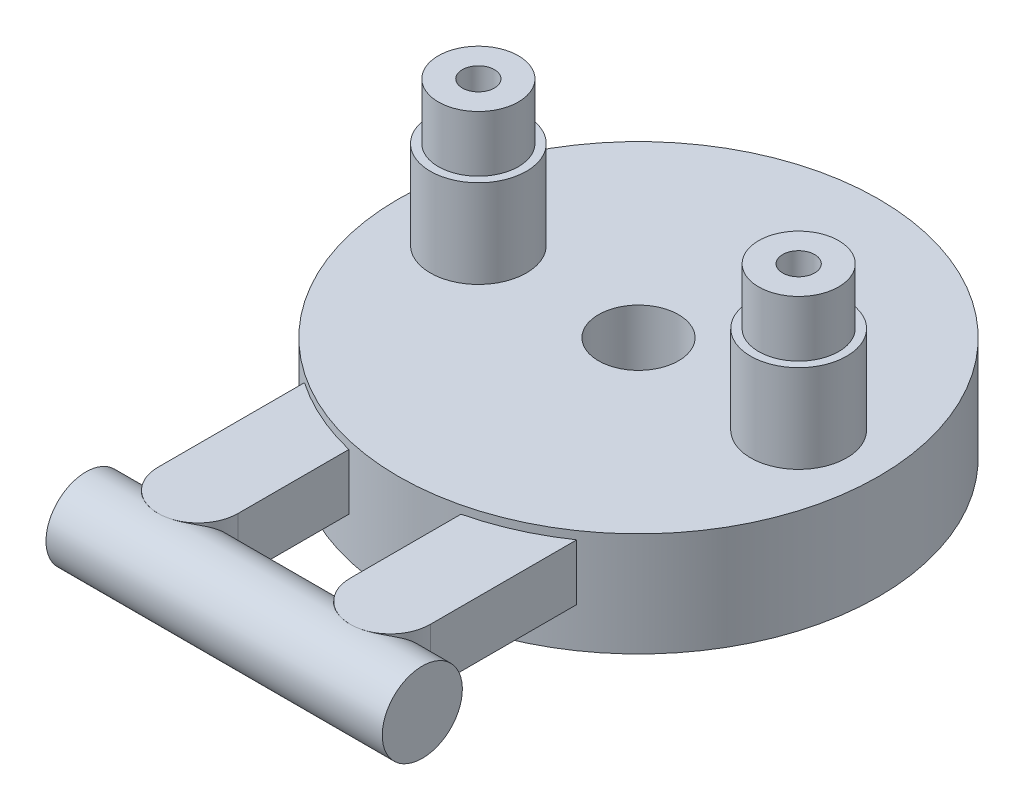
ISO-10303-21;
HEADER;
FILE_DESCRIPTION(('STEP AP214'),'2;1');
FILE_NAME('part.step','',(''),(''),'','','');
FILE_SCHEMA(('AUTOMOTIVE_DESIGN { 1 0 10303 214 1 1 1 1 }'));
ENDSEC;
DATA;
#1=APPLICATION_CONTEXT('core data for automotive mechanical design processes');
#2=APPLICATION_PROTOCOL_DEFINITION('international standard','automotive_design',2000,#1);
#3=PRODUCT_CONTEXT('',#1,'mechanical');
#4=PRODUCT('Part','Part','',(#3));
#5=PRODUCT_RELATED_PRODUCT_CATEGORY('part','',(#4));
#6=PRODUCT_DEFINITION_FORMATION('','',#4);
#7=PRODUCT_DEFINITION_CONTEXT('part definition',#1,'design');
#8=PRODUCT_DEFINITION('design','',#6,#7);
#9=PRODUCT_DEFINITION_SHAPE('','',#8);
#10=(LENGTH_UNIT() NAMED_UNIT(*) SI_UNIT(.MILLI.,.METRE.));
#11=(NAMED_UNIT(*) PLANE_ANGLE_UNIT() SI_UNIT($,.RADIAN.));
#12=(NAMED_UNIT(*) SI_UNIT($,.STERADIAN.) SOLID_ANGLE_UNIT());
#13=UNCERTAINTY_MEASURE_WITH_UNIT(LENGTH_MEASURE(1.E-05),#10,'distance_accuracy_value','');
#14=(GEOMETRIC_REPRESENTATION_CONTEXT(3) GLOBAL_UNCERTAINTY_ASSIGNED_CONTEXT((#13)) GLOBAL_UNIT_ASSIGNED_CONTEXT((#10,
#11,#12)) REPRESENTATION_CONTEXT('',''));
#15=CARTESIAN_POINT('',(0.,0.,0.));
#16=DIRECTION('',(0.,0.,1.));
#17=DIRECTION('',(1.,0.,0.));
#18=AXIS2_PLACEMENT_3D('',#15,#16,#17);
#19=CARTESIAN_POINT('',(-10.,7.5,0.));
#20=DIRECTION('',(0.,1.,0.));
#21=DIRECTION('',(-1.,0.,0.));
#22=AXIS2_PLACEMENT_3D('',#19,#20,#21);
#23=PLANE('',#22);
#24=CARTESIAN_POINT('',(-10.,7.5,0.));
#25=DIRECTION('',(0.,1.,0.));
#26=DIRECTION('',(-1.,0.,0.));
#27=AXIS2_PLACEMENT_3D('',#24,#25,#26);
#28=CIRCLE('',#27,1.);
#29=CARTESIAN_POINT('',(-11.,7.5,0.));
#30=VERTEX_POINT('',#29);
#31=EDGE_CURVE('E20',#30,#30,#28,.T.);
#32=ORIENTED_EDGE('',*,*,#31,.T.);
#33=EDGE_LOOP('',(#32));
#34=FACE_BOUND('',#33,.T.);
#35=ADVANCED_FACE('F17',(#34),#23,.T.);
#36=CARTESIAN_POINT('',(10.,7.5,0.));
#37=DIRECTION('',(0.,1.,0.));
#38=DIRECTION('',(-1.,0.,0.));
#39=AXIS2_PLACEMENT_3D('',#36,#37,#38);
#40=PLANE('',#39);
#41=CARTESIAN_POINT('',(10.,7.5,0.));
#42=DIRECTION('',(0.,1.,0.));
#43=DIRECTION('',(-1.,0.,0.));
#44=AXIS2_PLACEMENT_3D('',#41,#42,#43);
#45=CIRCLE('',#44,1.);
#46=CARTESIAN_POINT('',(9.00000000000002,7.5,0.));
#47=VERTEX_POINT('',#46);
#48=EDGE_CURVE('E266',#47,#47,#45,.T.);
#49=ORIENTED_EDGE('',*,*,#48,.T.);
#50=EDGE_LOOP('',(#49));
#51=FACE_BOUND('',#50,.T.);
#52=ADVANCED_FACE('F668',(#51),#40,.T.);
#53=CARTESIAN_POINT('',(-10.,7.5,0.));
#54=DIRECTION('',(0.,1.,0.));
#55=DIRECTION('',(-1.,0.,0.));
#56=AXIS2_PLACEMENT_3D('',#53,#54,#55);
#57=CYLINDRICAL_SURFACE('',#56,1.);
#58=CARTESIAN_POINT('',(-10.,15.5,0.));
#59=DIRECTION('',(0.,1.,0.));
#60=DIRECTION('',(-1.,0.,0.));
#61=AXIS2_PLACEMENT_3D('',#58,#59,#60);
#62=CIRCLE('',#61,1.);
#63=CARTESIAN_POINT('',(-11.,15.5,0.));
#64=VERTEX_POINT('',#63);
#65=EDGE_CURVE('E655',#64,#64,#62,.F.);
#66=ORIENTED_EDGE('',*,*,#65,.F.);
#67=EDGE_LOOP('',(#66));
#68=FACE_BOUND('',#67,.T.);
#69=ORIENTED_EDGE('',*,*,#31,.F.);
#70=EDGE_LOOP('',(#69));
#71=FACE_BOUND('',#70,.T.);
#72=ADVANCED_FACE('F665',(#68,#71),#57,.F.);
#73=CARTESIAN_POINT('',(10.,7.5,0.));
#74=DIRECTION('',(0.,1.,0.));
#75=DIRECTION('',(-1.,0.,0.));
#76=AXIS2_PLACEMENT_3D('',#73,#74,#75);
#77=CYLINDRICAL_SURFACE('',#76,1.);
#78=CARTESIAN_POINT('',(10.,15.5,0.));
#79=DIRECTION('',(0.,1.,0.));
#80=DIRECTION('',(-1.,0.,0.));
#81=AXIS2_PLACEMENT_3D('',#78,#79,#80);
#82=CIRCLE('',#81,1.);
#83=CARTESIAN_POINT('',(9.00000000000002,15.5,0.));
#84=VERTEX_POINT('',#83);
#85=EDGE_CURVE('E652',#84,#84,#82,.F.);
#86=ORIENTED_EDGE('',*,*,#85,.F.);
#87=EDGE_LOOP('',(#86));
#88=FACE_BOUND('',#87,.T.);
#89=ORIENTED_EDGE('',*,*,#48,.F.);
#90=EDGE_LOOP('',(#89));
#91=FACE_BOUND('',#90,.T.);
#92=ADVANCED_FACE('F667',(#88,#91),#77,.F.);
#93=CARTESIAN_POINT('',(10.5,3.50000000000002,24.0000000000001));
#94=DIRECTION('',(1.,0.,0.));
#95=DIRECTION('',(0.,1.,0.));
#96=AXIS2_PLACEMENT_3D('',#93,#94,#95);
#97=PLANE('',#96);
#98=CARTESIAN_POINT('',(10.5,3.50000000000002,24.0000000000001));
#99=DIRECTION('',(-1.,0.,0.));
#100=DIRECTION('',(0.,-1.,0.));
#101=AXIS2_PLACEMENT_3D('',#98,#99,#100);
#102=CIRCLE('',#101,2.50000000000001);
#103=CARTESIAN_POINT('',(10.5,1.00000000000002,24.0000000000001));
#104=VERTEX_POINT('',#103);
#105=EDGE_CURVE('E645',#104,#104,#102,.T.);
#106=ORIENTED_EDGE('',*,*,#105,.F.);
#107=EDGE_LOOP('',(#106));
#108=FACE_BOUND('',#107,.T.);
#109=ADVANCED_FACE('F676',(#108),#97,.T.);
#110=CARTESIAN_POINT('',(-10.5,3.50000000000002,24.0000000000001));
#111=DIRECTION('',(1.,0.,0.));
#112=DIRECTION('',(0.,1.,0.));
#113=AXIS2_PLACEMENT_3D('',#110,#111,#112);
#114=PLANE('',#113);
#115=CARTESIAN_POINT('',(-10.5,3.50000000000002,24.0000000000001));
#116=DIRECTION('',(-1.,0.,0.));
#117=DIRECTION('',(0.,-1.,0.));
#118=AXIS2_PLACEMENT_3D('',#115,#116,#117);
#119=CIRCLE('',#118,2.50000000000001);
#120=CARTESIAN_POINT('',(-10.5,1.00000000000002,24.0000000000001));
#121=VERTEX_POINT('',#120);
#122=EDGE_CURVE('E876',#121,#121,#119,.F.);
#123=ORIENTED_EDGE('',*,*,#122,.F.);
#124=EDGE_LOOP('',(#123));
#125=FACE_BOUND('',#124,.T.);
#126=ADVANCED_FACE('F857',(#125),#114,.F.);
#127=CARTESIAN_POINT('',(0.,5.,0.));
#128=DIRECTION('',(0.,1.,0.));
#129=DIRECTION('',(-1.,0.,0.));
#130=AXIS2_PLACEMENT_3D('',#127,#128,#129);
#131=PLANE('',#130);
#132=CARTESIAN_POINT('',(0.,5.,0.));
#133=DIRECTION('',(0.,-1.,0.));
#134=DIRECTION('',(1.,0.,0.));
#135=AXIS2_PLACEMENT_3D('',#132,#133,#134);
#136=CIRCLE('',#135,13.5);
#137=CARTESIAN_POINT('',(6.09005623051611,5.,12.048286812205));
#138=VERTEX_POINT('',#137);
#139=CARTESIAN_POINT('',(-6.09005623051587,5.,12.0482868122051));
#140=VERTEX_POINT('',#139);
#141=EDGE_CURVE('E475',#138,#140,#136,.T.);
#142=ORIENTED_EDGE('',*,*,#141,.T.);
#143=DIRECTION('',(0.499999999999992,0.,-0.866025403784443));
#144=VECTOR('',#143,1.);
#145=CARTESIAN_POINT('',(-6.10048094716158,5.,12.06634295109));
#146=LINE('',#145,#144);
#147=CARTESIAN_POINT('',(-1.31501015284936,5.,3.77766439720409));
#148=VERTEX_POINT('',#147);
#149=EDGE_CURVE('E443',#148,#140,#146,.F.);
#150=ORIENTED_EDGE('',*,*,#149,.F.);
#151=CARTESIAN_POINT('',(0.,5.,0.));
#152=DIRECTION('',(0.,-1.,0.));
#153=DIRECTION('',(1.,0.,0.));
#154=AXIS2_PLACEMENT_3D('',#151,#152,#153);
#155=CIRCLE('',#154,4.00000000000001);
#156=CARTESIAN_POINT('',(1.31501015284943,5.,3.77766439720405));
#157=VERTEX_POINT('',#156);
#158=EDGE_CURVE('E439',#157,#148,#155,.T.);
#159=ORIENTED_EDGE('',*,*,#158,.F.);
#160=DIRECTION('',(-0.50000000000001,0.,-0.866025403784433));
#161=VECTOR('',#160,1.);
#162=CARTESIAN_POINT('',(6.10048094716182,5.,12.0663429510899));
#163=LINE('',#162,#161);
#164=EDGE_CURVE('E433',#157,#138,#163,.F.);
#165=ORIENTED_EDGE('',*,*,#164,.T.);
#166=EDGE_LOOP('',(#142,#150,#159,#165));
#167=FACE_BOUND('',#166,.T.);
#168=ADVANCED_FACE('F854',(#167),#131,.F.);
#169=CARTESIAN_POINT('',(0.,5.,0.));
#170=DIRECTION('',(0.,1.,0.));
#171=DIRECTION('',(-1.,0.,0.));
#172=AXIS2_PLACEMENT_3D('',#169,#170,#171);
#173=PLANE('',#172);
#174=DIRECTION('',(-0.50000000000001,0.,-0.866025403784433));
#175=VECTOR('',#174,1.);
#176=CARTESIAN_POINT('',(7.39951905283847,5.,11.3163429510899));
#177=LINE('',#176,#175);
#178=CARTESIAN_POINT('',(2.61404825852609,5.,3.02766439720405));
#179=VERTEX_POINT('',#178);
#180=CARTESIAN_POINT('',(7.38909433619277,5.,11.298286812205));
#181=VERTEX_POINT('',#180);
#182=EDGE_CURVE('E424',#179,#181,#177,.F.);
#183=ORIENTED_EDGE('',*,*,#182,.F.);
#184=CARTESIAN_POINT('',(0.,5.,0.));
#185=DIRECTION('',(0.,-1.,0.));
#186=DIRECTION('',(1.,0.,0.));
#187=AXIS2_PLACEMENT_3D('',#184,#185,#186);
#188=CIRCLE('',#187,4.00000000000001);
#189=CARTESIAN_POINT('',(3.92905841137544,5.,0.750000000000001));
#190=VERTEX_POINT('',#189);
#191=EDGE_CURVE('E417',#190,#179,#188,.T.);
#192=ORIENTED_EDGE('',*,*,#191,.F.);
#193=DIRECTION('',(1.,0.,0.));
#194=VECTOR('',#193,1.);
#195=CARTESIAN_POINT('',(4.00000000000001,5.,0.750000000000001));
#196=LINE('',#195,#194);
#197=CARTESIAN_POINT('',(13.4791505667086,5.,0.750000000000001));
#198=VERTEX_POINT('',#197);
#199=EDGE_CURVE('E429',#190,#198,#196,.T.);
#200=ORIENTED_EDGE('',*,*,#199,.T.);
#201=CARTESIAN_POINT('',(0.,5.,0.));
#202=DIRECTION('',(0.,-1.,0.));
#203=DIRECTION('',(1.,0.,0.));
#204=AXIS2_PLACEMENT_3D('',#201,#202,#203);
#205=CIRCLE('',#204,13.5);
#206=EDGE_CURVE('E428',#198,#181,#205,.T.);
#207=ORIENTED_EDGE('',*,*,#206,.T.);
#208=EDGE_LOOP('',(#183,#192,#200,#207));
#209=FACE_BOUND('',#208,.T.);
#210=ADVANCED_FACE('F856',(#209),#173,.F.);
#211=CARTESIAN_POINT('',(0.,6.5,0.));
#212=DIRECTION('',(0.,-1.,0.));
#213=DIRECTION('',(1.,0.,0.));
#214=AXIS2_PLACEMENT_3D('',#211,#212,#213);
#215=CYLINDRICAL_SURFACE('',#214,4.00000000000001);
#216=CARTESIAN_POINT('',(0.,0.,0.));
#217=DIRECTION('',(0.,-1.,0.));
#218=DIRECTION('',(1.,0.,0.));
#219=AXIS2_PLACEMENT_3D('',#216,#217,#218);
#220=CIRCLE('',#219,4.00000000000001);
#221=CARTESIAN_POINT('',(1.31501015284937,0.,-3.77766439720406));
#222=VERTEX_POINT('',#221);
#223=CARTESIAN_POINT('',(-1.3150101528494,0.,-3.77766439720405));
#224=VERTEX_POINT('',#223);
#225=EDGE_CURVE('E254',#222,#224,#220,.F.);
#226=ORIENTED_EDGE('',*,*,#225,.T.);
#227=DIRECTION('',(0.,1.,0.));
#228=VECTOR('',#227,1.);
#229=CARTESIAN_POINT('',(-1.31501015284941,0.,-3.77766439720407));
#230=LINE('',#229,#228);
#231=CARTESIAN_POINT('',(-1.3150101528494,5.00000000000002,-3.77766439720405));
#232=VERTEX_POINT('',#231);
#233=EDGE_CURVE('E274',#224,#232,#230,.T.);
#234=ORIENTED_EDGE('',*,*,#233,.T.);
#235=CARTESIAN_POINT('',(0.,5.,0.));
#236=DIRECTION('',(0.,-1.,0.));
#237=DIRECTION('',(1.,0.,0.));
#238=AXIS2_PLACEMENT_3D('',#235,#236,#237);
#239=CIRCLE('',#238,4.00000000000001);
#240=CARTESIAN_POINT('',(1.31501015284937,5.00000000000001,-3.77766439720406));
#241=VERTEX_POINT('',#240);
#242=EDGE_CURVE('E265',#232,#241,#239,.T.);
#243=ORIENTED_EDGE('',*,*,#242,.T.);
#244=DIRECTION('',(0.,1.,0.));
#245=VECTOR('',#244,1.);
#246=CARTESIAN_POINT('',(1.31501015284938,0.,-3.77766439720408));
#247=LINE('',#246,#245);
#248=EDGE_CURVE('E269',#222,#241,#247,.T.);
#249=ORIENTED_EDGE('',*,*,#248,.F.);
#250=EDGE_LOOP('',(#226,#234,#243,#249));
#251=FACE_BOUND('',#250,.T.);
#252=ADVANCED_FACE('F270',(#251),#215,.T.);
#253=CARTESIAN_POINT('',(0.,5.,0.));
#254=DIRECTION('',(0.,1.,0.));
#255=DIRECTION('',(-1.,0.,0.));
#256=AXIS2_PLACEMENT_3D('',#253,#254,#255);
#257=PLANE('',#256);
#258=DIRECTION('',(0.500000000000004,0.,0.866025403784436));
#259=VECTOR('',#258,1.);
#260=CARTESIAN_POINT('',(-6.10048094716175,5.00000000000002,-12.0663429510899));
#261=LINE('',#260,#259);
#262=CARTESIAN_POINT('',(-6.09005623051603,5.00000000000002,-12.048286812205));
#263=VERTEX_POINT('',#262);
#264=EDGE_CURVE('E407',#232,#263,#261,.F.);
#265=ORIENTED_EDGE('',*,*,#264,.T.);
#266=CARTESIAN_POINT('',(0.,5.,0.));
#267=DIRECTION('',(0.,-1.,0.));
#268=DIRECTION('',(1.,0.,0.));
#269=AXIS2_PLACEMENT_3D('',#266,#267,#268);
#270=CIRCLE('',#269,13.5);
#271=CARTESIAN_POINT('',(6.09005623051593,5.00000000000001,-12.0482868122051));
#272=VERTEX_POINT('',#271);
#273=EDGE_CURVE('E420',#263,#272,#270,.T.);
#274=ORIENTED_EDGE('',*,*,#273,.T.);
#275=DIRECTION('',(-0.499999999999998,0.,0.86602540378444));
#276=VECTOR('',#275,1.);
#277=CARTESIAN_POINT('',(6.10048094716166,5.00000000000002,-12.06634295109));
#278=LINE('',#277,#276);
#279=EDGE_CURVE('E411',#241,#272,#278,.F.);
#280=ORIENTED_EDGE('',*,*,#279,.F.);
#281=ORIENTED_EDGE('',*,*,#242,.F.);
#282=EDGE_LOOP('',(#265,#274,#280,#281));
#283=FACE_BOUND('',#282,.T.);
#284=ADVANCED_FACE('F923',(#283),#257,.F.);
#285=CARTESIAN_POINT('',(0.,5.,0.));
#286=DIRECTION('',(0.,1.,0.));
#287=DIRECTION('',(-1.,0.,0.));
#288=AXIS2_PLACEMENT_3D('',#285,#286,#287);
#289=PLANE('',#288);
#290=CARTESIAN_POINT('',(0.,5.00000000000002,0.));
#291=DIRECTION('',(0.,-1.,0.));
#292=DIRECTION('',(1.,0.,0.));
#293=AXIS2_PLACEMENT_3D('',#290,#291,#292);
#294=CIRCLE('',#293,13.5);
#295=CARTESIAN_POINT('',(-13.4791505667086,5.00000000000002,-0.749999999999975));
#296=VERTEX_POINT('',#295);
#297=CARTESIAN_POINT('',(-7.38909433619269,5.00000000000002,-11.298286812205));
#298=VERTEX_POINT('',#297);
#299=EDGE_CURVE('E404',#296,#298,#294,.T.);
#300=ORIENTED_EDGE('',*,*,#299,.T.);
#301=DIRECTION('',(0.500000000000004,0.,0.866025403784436));
#302=VECTOR('',#301,1.);
#303=CARTESIAN_POINT('',(-7.39951905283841,5.00000000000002,-11.3163429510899));
#304=LINE('',#303,#302);
#305=CARTESIAN_POINT('',(-2.61404825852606,5.00000000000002,-3.02766439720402));
#306=VERTEX_POINT('',#305);
#307=EDGE_CURVE('E400',#306,#298,#304,.F.);
#308=ORIENTED_EDGE('',*,*,#307,.F.);
#309=CARTESIAN_POINT('',(0.,5.00000000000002,0.));
#310=DIRECTION('',(0.,-1.,0.));
#311=DIRECTION('',(1.,0.,0.));
#312=AXIS2_PLACEMENT_3D('',#309,#310,#311);
#313=CIRCLE('',#312,4.00000000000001);
#314=CARTESIAN_POINT('',(-3.92905841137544,5.00000000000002,-0.749999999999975));
#315=VERTEX_POINT('',#314);
#316=EDGE_CURVE('E393',#315,#306,#313,.T.);
#317=ORIENTED_EDGE('',*,*,#316,.F.);
#318=DIRECTION('',(1.,0.,0.));
#319=VECTOR('',#318,1.);
#320=CARTESIAN_POINT('',(-13.5,5.00000000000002,-0.749999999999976));
#321=LINE('',#320,#319);
#322=EDGE_CURVE('E405',#315,#296,#321,.F.);
#323=ORIENTED_EDGE('',*,*,#322,.T.);
#324=EDGE_LOOP('',(#300,#308,#317,#323));
#325=FACE_BOUND('',#324,.T.);
#326=ADVANCED_FACE('F919',(#325),#289,.F.);
#327=CARTESIAN_POINT('',(0.,5.,0.));
#328=DIRECTION('',(0.,1.,0.));
#329=DIRECTION('',(-1.,0.,0.));
#330=AXIS2_PLACEMENT_3D('',#327,#328,#329);
#331=PLANE('',#330);
#332=CARTESIAN_POINT('',(0.,5.,0.));
#333=DIRECTION('',(0.,-1.,0.));
#334=DIRECTION('',(1.,0.,0.));
#335=AXIS2_PLACEMENT_3D('',#332,#333,#334);
#336=CIRCLE('',#335,13.5);
#337=CARTESIAN_POINT('',(-7.38909433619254,5.,11.2982868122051));
#338=VERTEX_POINT('',#337);
#339=CARTESIAN_POINT('',(-13.4791505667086,5.,0.750000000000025));
#340=VERTEX_POINT('',#339);
#341=EDGE_CURVE('E392',#338,#340,#336,.T.);
#342=ORIENTED_EDGE('',*,*,#341,.T.);
#343=DIRECTION('',(1.,0.,0.));
#344=VECTOR('',#343,1.);
#345=CARTESIAN_POINT('',(-13.5,5.,0.750000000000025));
#346=LINE('',#345,#344);
#347=CARTESIAN_POINT('',(-3.92905841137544,5.,0.750000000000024));
#348=VERTEX_POINT('',#347);
#349=EDGE_CURVE('E388',#348,#340,#346,.F.);
#350=ORIENTED_EDGE('',*,*,#349,.F.);
#351=CARTESIAN_POINT('',(0.,5.,0.));
#352=DIRECTION('',(0.,-1.,0.));
#353=DIRECTION('',(1.,0.,0.));
#354=AXIS2_PLACEMENT_3D('',#351,#352,#353);
#355=CIRCLE('',#354,4.00000000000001);
#356=CARTESIAN_POINT('',(-2.61404825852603,5.,3.02766439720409));
#357=VERTEX_POINT('',#356);
#358=EDGE_CURVE('E384',#357,#348,#355,.T.);
#359=ORIENTED_EDGE('',*,*,#358,.F.);
#360=DIRECTION('',(0.499999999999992,0.,-0.866025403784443));
#361=VECTOR('',#360,1.);
#362=CARTESIAN_POINT('',(-7.39951905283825,5.,11.31634295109));
#363=LINE('',#362,#361);
#364=EDGE_CURVE('E377',#357,#338,#363,.F.);
#365=ORIENTED_EDGE('',*,*,#364,.T.);
#366=EDGE_LOOP('',(#342,#350,#359,#365));
#367=FACE_BOUND('',#366,.T.);
#368=ADVANCED_FACE('F915',(#367),#331,.F.);
#369=CARTESIAN_POINT('',(0.,5.,0.));
#370=DIRECTION('',(0.,1.,0.));
#371=DIRECTION('',(-1.,0.,0.));
#372=AXIS2_PLACEMENT_3D('',#369,#370,#371);
#373=PLANE('',#372);
#374=CARTESIAN_POINT('',(0.,5.00000000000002,0.));
#375=DIRECTION('',(0.,-1.,0.));
#376=DIRECTION('',(1.,0.,0.));
#377=AXIS2_PLACEMENT_3D('',#374,#375,#376);
#378=CIRCLE('',#377,13.5);
#379=CARTESIAN_POINT('',(7.38909433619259,5.00000000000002,-11.2982868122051));
#380=VERTEX_POINT('',#379);
#381=CARTESIAN_POINT('',(13.4791505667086,5.00000000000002,-0.750000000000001));
#382=VERTEX_POINT('',#381);
#383=EDGE_CURVE('E381',#380,#382,#378,.T.);
#384=ORIENTED_EDGE('',*,*,#383,.T.);
#385=DIRECTION('',(1.,0.,0.));
#386=VECTOR('',#385,1.);
#387=CARTESIAN_POINT('',(4.00000000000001,5.00000000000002,-0.750000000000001));
#388=LINE('',#387,#386);
#389=CARTESIAN_POINT('',(3.92905841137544,5.00000000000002,-0.74999999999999));
#390=VERTEX_POINT('',#389);
#391=EDGE_CURVE('E373',#390,#382,#388,.T.);
#392=ORIENTED_EDGE('',*,*,#391,.F.);
#393=CARTESIAN_POINT('',(0.,5.00000000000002,0.));
#394=DIRECTION('',(0.,-1.,0.));
#395=DIRECTION('',(1.,0.,0.));
#396=AXIS2_PLACEMENT_3D('',#393,#394,#395);
#397=CIRCLE('',#396,4.00000000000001);
#398=CARTESIAN_POINT('',(2.61404825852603,5.00000000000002,-3.02766439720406));
#399=VERTEX_POINT('',#398);
#400=EDGE_CURVE('E369',#399,#390,#397,.T.);
#401=ORIENTED_EDGE('',*,*,#400,.F.);
#402=DIRECTION('',(-0.499999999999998,0.,0.86602540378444));
#403=VECTOR('',#402,1.);
#404=CARTESIAN_POINT('',(7.39951905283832,5.00000000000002,-11.31634295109));
#405=LINE('',#404,#403);
#406=EDGE_CURVE('E362',#399,#380,#405,.F.);
#407=ORIENTED_EDGE('',*,*,#406,.T.);
#408=EDGE_LOOP('',(#384,#392,#401,#407));
#409=FACE_BOUND('',#408,.T.);
#410=ADVANCED_FACE('F911',(#409),#373,.F.);
#411=CARTESIAN_POINT('',(-10.,15.5,0.));
#412=DIRECTION('',(0.,1.,0.));
#413=DIRECTION('',(-1.,0.,0.));
#414=AXIS2_PLACEMENT_3D('',#411,#412,#413);
#415=PLANE('',#414);
#416=CARTESIAN_POINT('',(-10.,15.5,0.));
#417=DIRECTION('',(0.,-1.,0.));
#418=DIRECTION('',(1.,0.,0.));
#419=AXIS2_PLACEMENT_3D('',#416,#417,#418);
#420=CIRCLE('',#419,2.50000000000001);
#421=CARTESIAN_POINT('',(-7.50000000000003,15.5,0.));
#422=VERTEX_POINT('',#421);
#423=EDGE_CURVE('E366',#422,#422,#420,.T.);
#424=ORIENTED_EDGE('',*,*,#423,.F.);
#425=EDGE_LOOP('',(#424));
#426=FACE_BOUND('',#425,.T.);
#427=ORIENTED_EDGE('',*,*,#65,.T.);
#428=EDGE_LOOP('',(#427));
#429=FACE_BOUND('',#428,.T.);
#430=ADVANCED_FACE('F904',(#426,#429),#415,.T.);
#431=CARTESIAN_POINT('',(10.,15.5,0.));
#432=DIRECTION('',(0.,1.,0.));
#433=DIRECTION('',(-1.,0.,0.));
#434=AXIS2_PLACEMENT_3D('',#431,#432,#433);
#435=PLANE('',#434);
#436=CARTESIAN_POINT('',(10.,15.5,0.));
#437=DIRECTION('',(0.,-1.,0.));
#438=DIRECTION('',(1.,0.,0.));
#439=AXIS2_PLACEMENT_3D('',#436,#437,#438);
#440=CIRCLE('',#439,2.50000000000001);
#441=CARTESIAN_POINT('',(12.5,15.5,0.));
#442=VERTEX_POINT('',#441);
#443=EDGE_CURVE('E544',#442,#442,#440,.T.);
#444=ORIENTED_EDGE('',*,*,#443,.F.);
#445=EDGE_LOOP('',(#444));
#446=FACE_BOUND('',#445,.T.);
#447=ORIENTED_EDGE('',*,*,#85,.T.);
#448=EDGE_LOOP('',(#447));
#449=FACE_BOUND('',#448,.T.);
#450=ADVANCED_FACE('F899',(#446,#449),#435,.T.);
#451=CARTESIAN_POINT('',(-6.00000000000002,2.5,21.5000000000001));
#452=DIRECTION('',(0.,1.,0.));
#453=DIRECTION('',(-1.,0.,0.));
#454=AXIS2_PLACEMENT_3D('',#451,#452,#453);
#455=CYLINDRICAL_SURFACE('',#454,2.50000000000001);
#456=CARTESIAN_POINT('',(-8.50000000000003,3.5,21.5000000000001));
#457=CARTESIAN_POINT('',(-8.49997722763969,3.42940220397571,21.4999918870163));
#458=CARTESIAN_POINT('',(-8.49999925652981,3.35880364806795,21.5029899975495));
#459=CARTESIAN_POINT('',(-8.49996857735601,3.21806757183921,21.5149459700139));
#460=CARTESIAN_POINT('',(-8.4999158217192,3.14793037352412,21.5239076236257));
#461=CARTESIAN_POINT('',(-8.49957379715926,3.00986265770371,21.5475338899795));
#462=CARTESIAN_POINT('',(-8.49928859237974,2.94191491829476,21.5620982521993));
#463=CARTESIAN_POINT('',(-8.49818522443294,2.80750886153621,21.5968213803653));
#464=CARTESIAN_POINT('',(-8.49736744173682,2.74104951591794,21.6169761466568));
#465=CARTESIAN_POINT('',(-8.49550525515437,2.64593829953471,21.6501989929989));
#466=CARTESIAN_POINT('',(-8.49483007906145,2.61650897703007,21.6611052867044));
#467=CARTESIAN_POINT('',(-8.49324175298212,2.5579724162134,21.6840604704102));
#468=CARTESIAN_POINT('',(-8.49232767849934,2.52886689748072,21.6961136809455));
#469=CARTESIAN_POINT('',(-8.49127261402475,2.50000000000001,21.7087121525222));
#470=B_SPLINE_CURVE_WITH_KNOTS('',3,(#456,#457,#458,#459,#460,#461,#462,#463,#464,#465,#466,
#467,#468,#469),.UNSPECIFIED.,.F.,.F.,(4,2,2,2,2,2,4),(0.,0.211731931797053,0.423598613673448,
0.631838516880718,0.839929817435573,0.934087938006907,1.0286159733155),.UNSPECIFIED.);
#471=CARTESIAN_POINT('',(-8.50000000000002,3.5,21.5000000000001));
#472=VERTEX_POINT('',#471);
#473=CARTESIAN_POINT('',(-8.49127261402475,2.50000000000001,21.7087121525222));
#474=VERTEX_POINT('',#473);
#475=EDGE_CURVE('E619',#472,#474,#470,.T.);
#476=ORIENTED_EDGE('',*,*,#475,.F.);
#477=DIRECTION('',(0.,1.,0.));
#478=VECTOR('',#477,1.);
#479=CARTESIAN_POINT('',(-8.50000000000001,2.5,21.5000000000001));
#480=LINE('',#479,#478);
#481=CARTESIAN_POINT('',(-8.50000000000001,2.5,21.5000000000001));
#482=VERTEX_POINT('',#481);
#483=EDGE_CURVE('E349',#482,#472,#480,.T.);
#484=ORIENTED_EDGE('',*,*,#483,.F.);
#485=CARTESIAN_POINT('',(-6.00000000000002,2.5,21.5000000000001));
#486=DIRECTION('',(0.,1.,0.));
#487=DIRECTION('',(-1.,0.,0.));
#488=AXIS2_PLACEMENT_3D('',#485,#486,#487);
#489=CIRCLE('',#488,2.50000000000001);
#490=EDGE_CURVE('E354',#482,#474,#489,.T.);
#491=ORIENTED_EDGE('',*,*,#490,.T.);
#492=EDGE_LOOP('',(#476,#484,#491));
#493=FACE_BOUND('',#492,.T.);
#494=ADVANCED_FACE('F897',(#493),#455,.T.);
#495=CARTESIAN_POINT('',(-6.00000000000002,2.5,21.5000000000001));
#496=DIRECTION('',(0.,1.,0.));
#497=DIRECTION('',(-1.,0.,0.));
#498=AXIS2_PLACEMENT_3D('',#495,#496,#497);
#499=CYLINDRICAL_SURFACE('',#498,2.50000000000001);
#500=CARTESIAN_POINT('',(-8.50000000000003,3.5,21.5000000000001));
#501=CARTESIAN_POINT('',(-8.49997854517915,3.56959398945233,21.4999927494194));
#502=CARTESIAN_POINT('',(-8.4999993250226,3.63918696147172,21.5029056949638));
#503=CARTESIAN_POINT('',(-8.49997031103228,3.77788792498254,21.5145198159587));
#504=CARTESIAN_POINT('',(-8.49992051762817,3.84699591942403,21.5232209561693));
#505=CARTESIAN_POINT('',(-8.49959503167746,3.98436553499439,21.5463796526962));
#506=CARTESIAN_POINT('',(-8.49931894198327,4.05262545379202,21.560847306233));
#507=CARTESIAN_POINT('',(-8.49823806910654,4.18769368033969,21.5954342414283));
#508=CARTESIAN_POINT('',(-8.49743329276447,4.25450200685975,21.6155534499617));
#509=CARTESIAN_POINT('',(-8.49489469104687,4.38626501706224,21.661324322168));
#510=CARTESIAN_POINT('',(-8.49315981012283,4.45121750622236,21.6869822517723));
#511=CARTESIAN_POINT('',(-8.48826407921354,4.57870372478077,21.7436173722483));
#512=CARTESIAN_POINT('',(-8.48510331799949,4.64123760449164,21.7745942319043));
#513=CARTESIAN_POINT('',(-8.47678320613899,4.76337317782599,21.8415892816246));
#514=CARTESIAN_POINT('',(-8.47162477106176,4.82297620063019,21.8776051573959));
#515=CARTESIAN_POINT('',(-8.45868040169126,4.93874594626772,21.9543148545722));
#516=CARTESIAN_POINT('',(-8.45089611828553,4.9949148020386,21.9950057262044));
#517=CARTESIAN_POINT('',(-8.43239940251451,5.10126911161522,22.0789718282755));
#518=CARTESIAN_POINT('',(-8.42181082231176,5.15160147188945,22.1220879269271));
#519=CARTESIAN_POINT('',(-8.39701736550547,5.24819660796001,22.2116642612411));
#520=CARTESIAN_POINT('',(-8.38281448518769,5.29446161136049,22.2581226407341));
#521=CARTESIAN_POINT('',(-8.35026980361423,5.38251132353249,22.3536816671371));
#522=CARTESIAN_POINT('',(-8.33193217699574,5.42430048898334,22.4027796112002));
#523=CARTESIAN_POINT('',(-8.29069904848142,5.50312087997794,22.5028123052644));
#524=CARTESIAN_POINT('',(-8.26780433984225,5.54015293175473,22.5537467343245));
#525=CARTESIAN_POINT('',(-8.19869813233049,5.63437475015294,22.6939281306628));
#526=CARTESIAN_POINT('',(-8.14762228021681,5.68669255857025,22.7841566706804));
#527=CARTESIAN_POINT('',(-8.03060644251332,5.77660601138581,22.9621872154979));
#528=CARTESIAN_POINT('',(-7.96466581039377,5.81420101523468,23.0499891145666));
#529=CARTESIAN_POINT('',(-7.82334085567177,5.87460681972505,23.213604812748));
#530=CARTESIAN_POINT('',(-7.7487241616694,5.89814745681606,23.2898183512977));
#531=CARTESIAN_POINT('',(-7.58904559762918,5.93597898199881,23.4329887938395));
#532=CARTESIAN_POINT('',(-7.503981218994,5.95026764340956,23.4999434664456));
#533=CARTESIAN_POINT('',(-7.31648598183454,5.97321158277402,23.6286253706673));
#534=CARTESIAN_POINT('',(-7.21316962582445,5.98117018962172,23.6891812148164));
#535=CARTESIAN_POINT('',(-6.99863742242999,5.99215206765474,23.7950031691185));
#536=CARTESIAN_POINT('',(-6.88741507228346,5.99517122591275,23.8402565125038));
#537=CARTESIAN_POINT('',(-6.71124880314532,5.9979817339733,23.8975895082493));
#538=CARTESIAN_POINT('',(-6.64812482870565,5.99861536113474,23.9154161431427));
#539=CARTESIAN_POINT('',(-6.52065090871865,5.99946542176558,23.9460613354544));
#540=CARTESIAN_POINT('',(-6.4563008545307,5.99968181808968,23.958879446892));
#541=CARTESIAN_POINT('',(-6.32682587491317,5.99993735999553,23.979410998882));
#542=CARTESIAN_POINT('',(-6.26170132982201,5.99997658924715,23.9871268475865));
#543=CARTESIAN_POINT('',(-6.13105192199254,5.99999954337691,23.9974237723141));
#544=CARTESIAN_POINT('',(-6.06552708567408,5.9999832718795,24.0000051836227));
#545=CARTESIAN_POINT('',(-6.00000000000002,6.00000000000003,24.0000000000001));
#546=B_SPLINE_CURVE_WITH_KNOTS('',3,(#500,#501,#502,#503,#504,#505,#506,#507,#508,#509,#510,
#511,#512,#513,#514,#515,#516,#517,#518,#519,#520,#521,#522,#523,#524,#525,#526,#527,#528,#529,
#530,#531,#532,#533,#534,#535,#536,#537,#538,#539,#540,#541,#542,#543,#544,#545),.UNSPECIFIED.,
.F.,.F.,(4,2,2,2,2,2,2,2,2,2,2,2,2,2,2,2,2,2,2,2,2,2,4),(0.,0.208719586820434,0.417437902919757,
0.626523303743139,0.835605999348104,1.04492648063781,1.25423393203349,1.46344556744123,
1.67252591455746,1.87358155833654,2.07452639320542,2.27526924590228,2.47597718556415,
2.82232593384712,3.16868974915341,3.49500358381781,3.82139592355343,4.18005955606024,
4.53902168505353,4.73563624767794,4.9322683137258,5.12880750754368,5.32533386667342),.UNSPECIFIED.);
#547=CARTESIAN_POINT('',(-6.00000000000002,6.00000000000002,24.0000000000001));
#548=VERTEX_POINT('',#547);
#549=EDGE_CURVE('E646',#472,#548,#546,.T.);
#550=ORIENTED_EDGE('',*,*,#549,.T.);
#551=CARTESIAN_POINT('',(-6.00000000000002,6.00000000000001,21.5000000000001));
#552=DIRECTION('',(0.,1.,0.));
#553=DIRECTION('',(-1.,0.,0.));
#554=AXIS2_PLACEMENT_3D('',#551,#552,#553);
#555=CIRCLE('',#554,2.50000000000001);
#556=CARTESIAN_POINT('',(-8.50000000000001,6.00000000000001,21.5000000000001));
#557=VERTEX_POINT('',#556);
#558=EDGE_CURVE('E331',#557,#548,#555,.T.);
#559=ORIENTED_EDGE('',*,*,#558,.F.);
#560=DIRECTION('',(0.,1.,0.));
#561=VECTOR('',#560,1.);
#562=CARTESIAN_POINT('',(-8.50000000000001,2.5,21.5000000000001));
#563=LINE('',#562,#561);
#564=EDGE_CURVE('E332',#472,#557,#563,.T.);
#565=ORIENTED_EDGE('',*,*,#564,.F.);
#566=EDGE_LOOP('',(#550,#559,#565));
#567=FACE_BOUND('',#566,.T.);
#568=ADVANCED_FACE('F634',(#567),#499,.T.);
#569=CARTESIAN_POINT('',(-6.00000000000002,2.5,21.5000000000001));
#570=DIRECTION('',(0.,1.,0.));
#571=DIRECTION('',(-1.,0.,0.));
#572=AXIS2_PLACEMENT_3D('',#569,#570,#571);
#573=CYLINDRICAL_SURFACE('',#572,2.50000000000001);
#574=CARTESIAN_POINT('',(-6.00000000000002,6.00000000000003,24.0000000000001));
#575=CARTESIAN_POINT('',(-5.9304060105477,5.99997854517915,24.0000072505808));
#576=CARTESIAN_POINT('',(-5.86081303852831,5.9999993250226,23.9970943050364));
#577=CARTESIAN_POINT('',(-5.72211207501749,5.99997031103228,23.9854801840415));
#578=CARTESIAN_POINT('',(-5.653004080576,5.99992051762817,23.9767790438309));
#579=CARTESIAN_POINT('',(-5.51563446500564,5.99959503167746,23.953620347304));
#580=CARTESIAN_POINT('',(-5.44737454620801,5.99931894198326,23.9391526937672));
#581=CARTESIAN_POINT('',(-5.31230631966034,5.99823806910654,23.9045657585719));
#582=CARTESIAN_POINT('',(-5.24549799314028,5.99743329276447,23.8844465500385));
#583=CARTESIAN_POINT('',(-5.11373498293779,5.99489469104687,23.8386756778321));
#584=CARTESIAN_POINT('',(-5.04878249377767,5.99315981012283,23.8130177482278));
#585=CARTESIAN_POINT('',(-4.92129627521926,5.98826407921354,23.7563826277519));
#586=CARTESIAN_POINT('',(-4.85876239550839,5.98510331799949,23.7254057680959));
#587=CARTESIAN_POINT('',(-4.73662682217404,5.97678320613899,23.6584107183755));
#588=CARTESIAN_POINT('',(-4.67702379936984,5.97162477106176,23.6223948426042));
#589=CARTESIAN_POINT('',(-4.56125405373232,5.95868040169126,23.545685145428));
#590=CARTESIAN_POINT('',(-4.50508519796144,5.95089611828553,23.5049942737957));
#591=CARTESIAN_POINT('',(-4.39873088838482,5.93239940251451,23.4210281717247));
#592=CARTESIAN_POINT('',(-4.34839852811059,5.92181082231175,23.3779120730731));
#593=CARTESIAN_POINT('',(-4.25180339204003,5.89701736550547,23.2883357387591));
#594=CARTESIAN_POINT('',(-4.20553838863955,5.88281448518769,23.241877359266));
#595=CARTESIAN_POINT('',(-4.11748867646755,5.85026980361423,23.146318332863));
#596=CARTESIAN_POINT('',(-4.0756995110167,5.83193217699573,23.0972203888));
#597=CARTESIAN_POINT('',(-3.99687912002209,5.79069904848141,22.9971876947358));
#598=CARTESIAN_POINT('',(-3.95984706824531,5.76780433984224,22.9462532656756));
#599=CARTESIAN_POINT('',(-3.8656252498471,5.69869813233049,22.8060718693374));
#600=CARTESIAN_POINT('',(-3.8133074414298,5.64762228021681,22.7158433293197));
#601=CARTESIAN_POINT('',(-3.72339398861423,5.53060644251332,22.5378127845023));
#602=CARTESIAN_POINT('',(-3.68579898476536,5.46466581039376,22.4500108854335));
#603=CARTESIAN_POINT('',(-3.62539318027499,5.32334085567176,22.2863951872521));
#604=CARTESIAN_POINT('',(-3.60185254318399,5.24872416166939,22.2101816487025));
#605=CARTESIAN_POINT('',(-3.56402101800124,5.08904559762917,22.0670112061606));
#606=CARTESIAN_POINT('',(-3.54973235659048,5.003981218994,22.0000565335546));
#607=CARTESIAN_POINT('',(-3.52678841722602,4.81648598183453,21.8713746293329));
#608=CARTESIAN_POINT('',(-3.51882981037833,4.71316962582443,21.8108187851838));
#609=CARTESIAN_POINT('',(-3.50784793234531,4.49863742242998,21.7049968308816));
#610=CARTESIAN_POINT('',(-3.5048287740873,4.38741507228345,21.6597434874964));
#611=CARTESIAN_POINT('',(-3.50201826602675,4.21124880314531,21.6024104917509));
#612=CARTESIAN_POINT('',(-3.50138463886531,4.14812482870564,21.5845838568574));
#613=CARTESIAN_POINT('',(-3.50053457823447,4.02065090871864,21.5539386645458));
#614=CARTESIAN_POINT('',(-3.50031818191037,3.95630085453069,21.5411205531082));
#615=CARTESIAN_POINT('',(-3.50006264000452,3.82682587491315,21.5205890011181));
#616=CARTESIAN_POINT('',(-3.5000234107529,3.761701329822,21.5128731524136));
#617=CARTESIAN_POINT('',(-3.50000045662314,3.63105192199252,21.502576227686));
#618=CARTESIAN_POINT('',(-3.50001672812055,3.56552708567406,21.4999948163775));
#619=CARTESIAN_POINT('',(-3.50000000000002,3.5,21.5000000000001));
#620=B_SPLINE_CURVE_WITH_KNOTS('',3,(#574,#575,#576,#577,#578,#579,#580,#581,#582,#583,#584,
#585,#586,#587,#588,#589,#590,#591,#592,#593,#594,#595,#596,#597,#598,#599,#600,#601,#602,#603,
#604,#605,#606,#607,#608,#609,#610,#611,#612,#613,#614,#615,#616,#617,#618,#619),.UNSPECIFIED.,
.F.,.F.,(4,2,2,2,2,2,2,2,2,2,2,2,2,2,2,2,2,2,2,2,2,2,4),(0.,0.208719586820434,0.417437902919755,
0.626523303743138,0.835605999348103,1.04492648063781,1.25423393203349,1.46344556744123,
1.67252591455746,1.87358155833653,2.07452639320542,2.27526924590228,2.47597718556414,
2.8223259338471,3.1686897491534,3.4950035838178,3.82139592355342,4.18005955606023,
4.53902168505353,4.73563624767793,4.9322683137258,5.12880750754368,5.32533386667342),.UNSPECIFIED.);
#621=CARTESIAN_POINT('',(-3.50000000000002,3.50000000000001,21.5000000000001));
#622=VERTEX_POINT('',#621);
#623=EDGE_CURVE('E638',#548,#622,#620,.T.);
#624=ORIENTED_EDGE('',*,*,#623,.T.);
#625=DIRECTION('',(0.,1.,0.));
#626=VECTOR('',#625,1.);
#627=CARTESIAN_POINT('',(-3.50000000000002,2.5,21.5000000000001));
#628=LINE('',#627,#626);
#629=CARTESIAN_POINT('',(-3.50000000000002,6.,21.5000000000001));
#630=VERTEX_POINT('',#629);
#631=EDGE_CURVE('E344',#630,#622,#628,.F.);
#632=ORIENTED_EDGE('',*,*,#631,.F.);
#633=CARTESIAN_POINT('',(-6.00000000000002,6.00000000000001,21.5000000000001));
#634=DIRECTION('',(0.,1.,0.));
#635=DIRECTION('',(-1.,0.,0.));
#636=AXIS2_PLACEMENT_3D('',#633,#634,#635);
#637=CIRCLE('',#636,2.50000000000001);
#638=EDGE_CURVE('E345',#548,#630,#637,.T.);
#639=ORIENTED_EDGE('',*,*,#638,.F.);
#640=EDGE_LOOP('',(#624,#632,#639));
#641=FACE_BOUND('',#640,.T.);
#642=ADVANCED_FACE('F629',(#641),#573,.T.);
#643=CARTESIAN_POINT('',(-6.00000000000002,2.5,21.5000000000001));
#644=DIRECTION('',(0.,1.,0.));
#645=DIRECTION('',(-1.,0.,0.));
#646=AXIS2_PLACEMENT_3D('',#643,#644,#645);
#647=CYLINDRICAL_SURFACE('',#646,2.50000000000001);
#648=CARTESIAN_POINT('',(-3.50872738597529,2.50000000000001,21.7087121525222));
#649=CARTESIAN_POINT('',(-3.50638064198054,2.56467056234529,21.6804777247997));
#650=CARTESIAN_POINT('',(-3.50471093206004,2.63055846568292,21.6549910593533));
#651=CARTESIAN_POINT('',(-3.50229802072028,2.7643013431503,21.6096604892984));
#652=CARTESIAN_POINT('',(-3.50155527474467,2.83215726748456,21.5898193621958));
#653=CARTESIAN_POINT('',(-3.50057855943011,2.96813993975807,21.5562425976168));
#654=CARTESIAN_POINT('',(-3.50033616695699,3.03624253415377,21.5424090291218));
#655=CARTESIAN_POINT('',(-3.50005915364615,3.17332737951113,21.5204642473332));
#656=CARTESIAN_POINT('',(-3.50002439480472,3.24230901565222,21.5123492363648));
#657=CARTESIAN_POINT('',(-3.50000367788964,3.34279045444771,21.5047501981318));
#658=CARTESIAN_POINT('',(-3.50000141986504,3.37413136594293,21.5029732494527));
#659=CARTESIAN_POINT('',(-3.499999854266,3.43698015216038,21.5005959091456));
#660=CARTESIAN_POINT('',(-3.50000055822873,3.46848820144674,21.5000001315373));
#661=CARTESIAN_POINT('',(-3.50000000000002,3.5,21.5000000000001));
#662=B_SPLINE_CURVE_WITH_KNOTS('',3,(#648,#649,#650,#651,#652,#653,#654,#655,#656,#657,#658,
#659,#660,#661),.UNSPECIFIED.,.F.,.F.,(4,2,2,2,2,2,4),(0.,0.211738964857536,0.423581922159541,
0.631828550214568,0.839936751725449,0.934091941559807,1.02861421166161),.UNSPECIFIED.);
#663=CARTESIAN_POINT('',(-3.50872738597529,2.50000000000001,21.7087121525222));
#664=VERTEX_POINT('',#663);
#665=EDGE_CURVE('E613',#664,#622,#662,.T.);
#666=ORIENTED_EDGE('',*,*,#665,.F.);
#667=CARTESIAN_POINT('',(-6.00000000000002,2.5,21.5000000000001));
#668=DIRECTION('',(0.,1.,0.));
#669=DIRECTION('',(-1.,0.,0.));
#670=AXIS2_PLACEMENT_3D('',#667,#668,#669);
#671=CIRCLE('',#670,2.50000000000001);
#672=CARTESIAN_POINT('',(-3.50000000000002,2.5,21.5000000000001));
#673=VERTEX_POINT('',#672);
#674=EDGE_CURVE('E350',#664,#673,#671,.T.);
#675=ORIENTED_EDGE('',*,*,#674,.T.);
#676=DIRECTION('',(0.,1.,0.));
#677=VECTOR('',#676,1.);
#678=CARTESIAN_POINT('',(-3.50000000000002,2.5,21.5000000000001));
#679=LINE('',#678,#677);
#680=EDGE_CURVE('E358',#622,#673,#679,.F.);
#681=ORIENTED_EDGE('',*,*,#680,.F.);
#682=EDGE_LOOP('',(#666,#675,#681));
#683=FACE_BOUND('',#682,.T.);
#684=ADVANCED_FACE('F625',(#683),#647,.T.);
#685=CARTESIAN_POINT('',(10.5,3.50000000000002,24.0000000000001));
#686=DIRECTION('',(-1.,0.,0.));
#687=DIRECTION('',(0.,-1.,0.));
#688=AXIS2_PLACEMENT_3D('',#685,#686,#687);
#689=CYLINDRICAL_SURFACE('',#688,2.50000000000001);
#690=ORIENTED_EDGE('',*,*,#105,.T.);
#691=EDGE_LOOP('',(#690));
#692=FACE_BOUND('',#691,.T.);
#693=ORIENTED_EDGE('',*,*,#122,.T.);
#694=EDGE_LOOP('',(#693));
#695=FACE_BOUND('',#694,.T.);
#696=ORIENTED_EDGE('',*,*,#549,.F.);
#697=ORIENTED_EDGE('',*,*,#475,.T.);
#698=DIRECTION('',(-1.,0.,0.));
#699=VECTOR('',#698,1.);
#700=CARTESIAN_POINT('',(-6.00000000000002,2.5,21.7087121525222));
#701=LINE('',#700,#699);
#702=EDGE_CURVE('E351',#474,#664,#701,.F.);
#703=ORIENTED_EDGE('',*,*,#702,.T.);
#704=ORIENTED_EDGE('',*,*,#665,.T.);
#705=ORIENTED_EDGE('',*,*,#623,.F.);
#706=EDGE_LOOP('',(#696,#697,#703,#704,#705));
#707=FACE_BOUND('',#706,.T.);
#708=DIRECTION('',(-1.,0.,0.));
#709=VECTOR('',#708,1.);
#710=CARTESIAN_POINT('',(0.,2.5,21.7087121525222));
#711=LINE('',#710,#709);
#712=CARTESIAN_POINT('',(3.50872738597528,2.50000000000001,21.7087121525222));
#713=VERTEX_POINT('',#712);
#714=CARTESIAN_POINT('',(8.49127261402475,2.50000000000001,21.7087121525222));
#715=VERTEX_POINT('',#714);
#716=EDGE_CURVE('E322',#713,#715,#711,.F.);
#717=ORIENTED_EDGE('',*,*,#716,.T.);
#718=CARTESIAN_POINT('',(8.50000000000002,3.5,21.5000000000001));
#719=CARTESIAN_POINT('',(8.49997722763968,3.42940220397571,21.4999918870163));
#720=CARTESIAN_POINT('',(8.4999992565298,3.35880364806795,21.5029899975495));
#721=CARTESIAN_POINT('',(8.49996857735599,3.21806757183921,21.5149459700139));
#722=CARTESIAN_POINT('',(8.49991582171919,3.14793037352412,21.5239076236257));
#723=CARTESIAN_POINT('',(8.49957379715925,3.00986265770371,21.5475338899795));
#724=CARTESIAN_POINT('',(8.49928859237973,2.94191491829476,21.5620982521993));
#725=CARTESIAN_POINT('',(8.49818522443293,2.80750886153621,21.5968213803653));
#726=CARTESIAN_POINT('',(8.49736744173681,2.74104951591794,21.6169761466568));
#727=CARTESIAN_POINT('',(8.49550525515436,2.64593829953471,21.6501989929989));
#728=CARTESIAN_POINT('',(8.49483007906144,2.61650897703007,21.6611052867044));
#729=CARTESIAN_POINT('',(8.4932417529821,2.5579724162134,21.6840604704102));
#730=CARTESIAN_POINT('',(8.49232767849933,2.52886689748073,21.6961136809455));
#731=CARTESIAN_POINT('',(8.49127261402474,2.50000000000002,21.7087121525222));
#732=B_SPLINE_CURVE_WITH_KNOTS('',3,(#718,#719,#720,#721,#722,#723,#724,#725,#726,#727,#728,
#729,#730,#731),.UNSPECIFIED.,.F.,.F.,(4,2,2,2,2,2,4),(0.,0.211731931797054,0.423598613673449,
0.63183851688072,0.839929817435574,0.934087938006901,1.02861597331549),.UNSPECIFIED.);
#733=CARTESIAN_POINT('',(8.50000000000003,3.5,21.5000000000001));
#734=VERTEX_POINT('',#733);
#735=EDGE_CURVE('E565',#734,#715,#732,.T.);
#736=ORIENTED_EDGE('',*,*,#735,.F.);
#737=CARTESIAN_POINT('',(6.00000000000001,6.00000000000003,24.0000000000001));
#738=CARTESIAN_POINT('',(6.06959398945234,5.99997854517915,24.0000072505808));
#739=CARTESIAN_POINT('',(6.13918696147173,5.9999993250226,23.9970943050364));
#740=CARTESIAN_POINT('',(6.27788792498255,5.99997031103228,23.9854801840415));
#741=CARTESIAN_POINT('',(6.34699591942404,5.99992051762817,23.9767790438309));
#742=CARTESIAN_POINT('',(6.4843655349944,5.99959503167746,23.953620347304));
#743=CARTESIAN_POINT('',(6.55262545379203,5.99931894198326,23.9391526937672));
#744=CARTESIAN_POINT('',(6.6876936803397,5.99823806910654,23.9045657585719));
#745=CARTESIAN_POINT('',(6.75450200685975,5.99743329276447,23.8844465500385));
#746=CARTESIAN_POINT('',(6.88626501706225,5.99489469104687,23.8386756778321));
#747=CARTESIAN_POINT('',(6.95121750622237,5.99315981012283,23.8130177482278));
#748=CARTESIAN_POINT('',(7.07870372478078,5.98826407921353,23.7563826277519));
#749=CARTESIAN_POINT('',(7.14123760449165,5.98510331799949,23.7254057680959));
#750=CARTESIAN_POINT('',(7.263373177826,5.97678320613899,23.6584107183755));
#751=CARTESIAN_POINT('',(7.3229762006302,5.97162477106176,23.6223948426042));
#752=CARTESIAN_POINT('',(7.43874594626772,5.95868040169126,23.545685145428));
#753=CARTESIAN_POINT('',(7.4949148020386,5.95089611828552,23.5049942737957));
#754=CARTESIAN_POINT('',(7.60126911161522,5.93239940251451,23.4210281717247));
#755=CARTESIAN_POINT('',(7.65160147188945,5.92181082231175,23.3779120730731));
#756=CARTESIAN_POINT('',(7.74819660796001,5.89701736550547,23.2883357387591));
#757=CARTESIAN_POINT('',(7.79446161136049,5.88281448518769,23.241877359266));
#758=CARTESIAN_POINT('',(7.88251132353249,5.85026980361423,23.146318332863));
#759=CARTESIAN_POINT('',(7.92430048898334,5.83193217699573,23.0972203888));
#760=CARTESIAN_POINT('',(8.00312087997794,5.79069904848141,22.9971876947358));
#761=CARTESIAN_POINT('',(8.04015293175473,5.76780433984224,22.9462532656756));
#762=CARTESIAN_POINT('',(8.13437475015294,5.69869813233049,22.8060718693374));
#763=CARTESIAN_POINT('',(8.18669255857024,5.6476222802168,22.7158433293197));
#764=CARTESIAN_POINT('',(8.2766060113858,5.53060644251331,22.5378127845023));
#765=CARTESIAN_POINT('',(8.31420101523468,5.46466581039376,22.4500108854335));
#766=CARTESIAN_POINT('',(8.37460681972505,5.32334085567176,22.2863951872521));
#767=CARTESIAN_POINT('',(8.39814745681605,5.24872416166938,22.2101816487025));
#768=CARTESIAN_POINT('',(8.4359789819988,5.08904559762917,22.0670112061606));
#769=CARTESIAN_POINT('',(8.45026764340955,5.00398121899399,22.0000565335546));
#770=CARTESIAN_POINT('',(8.47321158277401,4.81648598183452,21.8713746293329));
#771=CARTESIAN_POINT('',(8.48117018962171,4.71316962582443,21.8108187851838));
#772=CARTESIAN_POINT('',(8.49215206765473,4.49863742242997,21.7049968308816));
#773=CARTESIAN_POINT('',(8.49517122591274,4.38741507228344,21.6597434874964));
#774=CARTESIAN_POINT('',(8.49798173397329,4.21124880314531,21.6024104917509));
#775=CARTESIAN_POINT('',(8.49861536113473,4.14812482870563,21.5845838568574));
#776=CARTESIAN_POINT('',(8.49946542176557,4.02065090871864,21.5539386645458));
#777=CARTESIAN_POINT('',(8.49968181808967,3.95630085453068,21.5411205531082));
#778=CARTESIAN_POINT('',(8.49993735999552,3.82682587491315,21.5205890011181));
#779=CARTESIAN_POINT('',(8.49997658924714,3.76170132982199,21.5128731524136));
#780=CARTESIAN_POINT('',(8.49999954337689,3.63105192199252,21.502576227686));
#781=CARTESIAN_POINT('',(8.49998327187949,3.56552708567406,21.4999948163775));
#782=CARTESIAN_POINT('',(8.50000000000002,3.5,21.5000000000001));
#783=B_SPLINE_CURVE_WITH_KNOTS('',3,(#737,#738,#739,#740,#741,#742,#743,#744,#745,#746,#747,
#748,#749,#750,#751,#752,#753,#754,#755,#756,#757,#758,#759,#760,#761,#762,#763,#764,#765,#766,
#767,#768,#769,#770,#771,#772,#773,#774,#775,#776,#777,#778,#779,#780,#781,#782),.UNSPECIFIED.,
.F.,.F.,(4,2,2,2,2,2,2,2,2,2,2,2,2,2,2,2,2,2,2,2,2,2,4),(0.,0.208719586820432,0.417437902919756,
0.626523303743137,0.835605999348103,1.04492648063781,1.25423393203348,1.46344556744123,
1.67252591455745,1.87358155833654,2.07452639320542,2.27526924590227,2.47597718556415,
2.82232593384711,3.16868974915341,3.4950035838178,3.82139592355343,4.18005955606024,
4.53902168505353,4.73563624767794,4.9322683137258,5.12880750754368,5.32533386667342),.UNSPECIFIED.);
#784=CARTESIAN_POINT('',(6.00000000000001,6.00000000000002,24.0000000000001));
#785=VERTEX_POINT('',#784);
#786=EDGE_CURVE('E573',#785,#734,#783,.T.);
#787=ORIENTED_EDGE('',*,*,#786,.F.);
#788=CARTESIAN_POINT('',(3.50000000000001,3.5,21.5000000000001));
#789=CARTESIAN_POINT('',(3.50002145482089,3.56959398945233,21.4999927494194));
#790=CARTESIAN_POINT('',(3.50000067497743,3.63918696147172,21.5029056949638));
#791=CARTESIAN_POINT('',(3.50002968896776,3.77788792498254,21.5145198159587));
#792=CARTESIAN_POINT('',(3.50007948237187,3.84699591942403,21.5232209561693));
#793=CARTESIAN_POINT('',(3.50040496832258,3.98436553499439,21.5463796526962));
#794=CARTESIAN_POINT('',(3.50068105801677,4.05262545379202,21.560847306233));
#795=CARTESIAN_POINT('',(3.50176193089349,4.18769368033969,21.5954342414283));
#796=CARTESIAN_POINT('',(3.50256670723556,4.25450200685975,21.6155534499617));
#797=CARTESIAN_POINT('',(3.50510530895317,4.38626501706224,21.661324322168));
#798=CARTESIAN_POINT('',(3.5068401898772,4.45121750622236,21.6869822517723));
#799=CARTESIAN_POINT('',(3.5117359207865,4.57870372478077,21.7436173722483));
#800=CARTESIAN_POINT('',(3.51489668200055,4.64123760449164,21.7745942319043));
#801=CARTESIAN_POINT('',(3.52321679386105,4.76337317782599,21.8415892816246));
#802=CARTESIAN_POINT('',(3.52837522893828,4.82297620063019,21.8776051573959));
#803=CARTESIAN_POINT('',(3.54131959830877,4.93874594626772,21.9543148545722));
#804=CARTESIAN_POINT('',(3.54910388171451,4.9949148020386,21.9950057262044));
#805=CARTESIAN_POINT('',(3.56760059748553,5.10126911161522,22.0789718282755));
#806=CARTESIAN_POINT('',(3.57818917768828,5.15160147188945,22.1220879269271));
#807=CARTESIAN_POINT('',(3.60298263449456,5.24819660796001,22.2116642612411));
#808=CARTESIAN_POINT('',(3.61718551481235,5.29446161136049,22.2581226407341));
#809=CARTESIAN_POINT('',(3.6497301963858,5.38251132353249,22.3536816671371));
#810=CARTESIAN_POINT('',(3.6680678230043,5.42430048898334,22.4027796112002));
#811=CARTESIAN_POINT('',(3.70930095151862,5.50312087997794,22.5028123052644));
#812=CARTESIAN_POINT('',(3.73219566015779,5.54015293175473,22.5537467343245));
#813=CARTESIAN_POINT('',(3.80130186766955,5.63437475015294,22.6939281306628));
#814=CARTESIAN_POINT('',(3.85237771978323,5.68669255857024,22.7841566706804));
#815=CARTESIAN_POINT('',(3.96939355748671,5.77660601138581,22.9621872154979));
#816=CARTESIAN_POINT('',(4.03533418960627,5.81420101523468,23.0499891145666));
#817=CARTESIAN_POINT('',(4.17665914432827,5.87460681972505,23.213604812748));
#818=CARTESIAN_POINT('',(4.25127583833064,5.89814745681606,23.2898183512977));
#819=CARTESIAN_POINT('',(4.41095440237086,5.93597898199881,23.4329887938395));
#820=CARTESIAN_POINT('',(4.49601878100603,5.95026764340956,23.4999434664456));
#821=CARTESIAN_POINT('',(4.6835140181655,5.97321158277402,23.6286253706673));
#822=CARTESIAN_POINT('',(4.78683037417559,5.98117018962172,23.6891812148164));
#823=CARTESIAN_POINT('',(5.00136257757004,5.99215206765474,23.7950031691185));
#824=CARTESIAN_POINT('',(5.11258492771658,5.99517122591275,23.8402565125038));
#825=CARTESIAN_POINT('',(5.28875119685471,5.9979817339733,23.8975895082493));
#826=CARTESIAN_POINT('',(5.35187517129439,5.99861536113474,23.9154161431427));
#827=CARTESIAN_POINT('',(5.47934909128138,5.99946542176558,23.9460613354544));
#828=CARTESIAN_POINT('',(5.54369914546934,5.99968181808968,23.958879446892));
#829=CARTESIAN_POINT('',(5.67317412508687,5.99993735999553,23.979410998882));
#830=CARTESIAN_POINT('',(5.73829867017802,5.99997658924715,23.9871268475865));
#831=CARTESIAN_POINT('',(5.86894807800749,5.99999954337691,23.9974237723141));
#832=CARTESIAN_POINT('',(5.93447291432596,5.9999832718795,24.0000051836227));
#833=CARTESIAN_POINT('',(6.00000000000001,6.00000000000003,24.0000000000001));
#834=B_SPLINE_CURVE_WITH_KNOTS('',3,(#788,#789,#790,#791,#792,#793,#794,#795,#796,#797,#798,
#799,#800,#801,#802,#803,#804,#805,#806,#807,#808,#809,#810,#811,#812,#813,#814,#815,#816,#817,
#818,#819,#820,#821,#822,#823,#824,#825,#826,#827,#828,#829,#830,#831,#832,#833),.UNSPECIFIED.,
.F.,.F.,(4,2,2,2,2,2,2,2,2,2,2,2,2,2,2,2,2,2,2,2,2,2,4),(0.,0.208719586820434,0.417437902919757,
0.626523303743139,0.835605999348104,1.04492648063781,1.25423393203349,1.46344556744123,
1.67252591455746,1.87358155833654,2.07452639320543,2.27526924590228,2.47597718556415,
2.82232593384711,3.16868974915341,3.49500358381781,3.82139592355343,4.18005955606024,
4.53902168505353,4.73563624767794,4.9322683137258,5.12880750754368,5.32533386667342),.UNSPECIFIED.);
#835=CARTESIAN_POINT('',(3.50000000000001,3.5,21.5000000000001));
#836=VERTEX_POINT('',#835);
#837=EDGE_CURVE('E601',#836,#785,#834,.T.);
#838=ORIENTED_EDGE('',*,*,#837,.F.);
#839=CARTESIAN_POINT('',(3.50872738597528,2.50000000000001,21.7087121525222));
#840=CARTESIAN_POINT('',(3.50638064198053,2.56467056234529,21.6804777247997));
#841=CARTESIAN_POINT('',(3.50471093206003,2.63055846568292,21.6549910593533));
#842=CARTESIAN_POINT('',(3.50229802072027,2.7643013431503,21.6096604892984));
#843=CARTESIAN_POINT('',(3.50155527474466,2.83215726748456,21.5898193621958));
#844=CARTESIAN_POINT('',(3.5005785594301,2.96813993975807,21.5562425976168));
#845=CARTESIAN_POINT('',(3.50033616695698,3.03624253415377,21.5424090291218));
#846=CARTESIAN_POINT('',(3.50005915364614,3.17332737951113,21.5204642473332));
#847=CARTESIAN_POINT('',(3.50002439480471,3.24230901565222,21.5123492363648));
#848=CARTESIAN_POINT('',(3.50000367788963,3.34279045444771,21.5047501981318));
#849=CARTESIAN_POINT('',(3.50000141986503,3.37413136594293,21.5029732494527));
#850=CARTESIAN_POINT('',(3.49999985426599,3.43698015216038,21.5005959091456));
#851=CARTESIAN_POINT('',(3.50000055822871,3.46848820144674,21.5000001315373));
#852=CARTESIAN_POINT('',(3.50000000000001,3.5,21.5000000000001));
#853=B_SPLINE_CURVE_WITH_KNOTS('',3,(#839,#840,#841,#842,#843,#844,#845,#846,#847,#848,#849,
#850,#851,#852),.UNSPECIFIED.,.F.,.F.,(4,2,2,2,2,2,4),(0.,0.211738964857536,0.423581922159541,
0.631828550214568,0.839936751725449,0.934091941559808,1.02861421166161),.UNSPECIFIED.);
#854=EDGE_CURVE('E607',#713,#836,#853,.T.);
#855=ORIENTED_EDGE('',*,*,#854,.F.);
#856=EDGE_LOOP('',(#717,#736,#787,#838,#855));
#857=FACE_BOUND('',#856,.T.);
#858=ADVANCED_FACE('F579',(#692,#695,#707,#857),#689,.T.);
#859=CARTESIAN_POINT('',(6.00000000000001,2.5,21.5000000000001));
#860=DIRECTION('',(0.,1.,0.));
#861=DIRECTION('',(-1.,0.,0.));
#862=AXIS2_PLACEMENT_3D('',#859,#860,#861);
#863=CYLINDRICAL_SURFACE('',#862,2.50000000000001);
#864=DIRECTION('',(0.,1.,0.));
#865=VECTOR('',#864,1.);
#866=CARTESIAN_POINT('',(3.50000000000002,2.5,21.5000000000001));
#867=LINE('',#866,#865);
#868=CARTESIAN_POINT('',(3.50000000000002,2.5,21.5000000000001));
#869=VERTEX_POINT('',#868);
#870=EDGE_CURVE('E320',#869,#836,#867,.T.);
#871=ORIENTED_EDGE('',*,*,#870,.F.);
#872=CARTESIAN_POINT('',(6.00000000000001,2.5,21.5000000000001));
#873=DIRECTION('',(0.,1.,0.));
#874=DIRECTION('',(-1.,0.,0.));
#875=AXIS2_PLACEMENT_3D('',#872,#873,#874);
#876=CIRCLE('',#875,2.50000000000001);
#877=EDGE_CURVE('E324',#869,#713,#876,.T.);
#878=ORIENTED_EDGE('',*,*,#877,.T.);
#879=ORIENTED_EDGE('',*,*,#854,.T.);
#880=EDGE_LOOP('',(#871,#878,#879));
#881=FACE_BOUND('',#880,.T.);
#882=ADVANCED_FACE('F598',(#881),#863,.T.);
#883=CARTESIAN_POINT('',(6.00000000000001,2.5,21.5000000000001));
#884=DIRECTION('',(0.,1.,0.));
#885=DIRECTION('',(-1.,0.,0.));
#886=AXIS2_PLACEMENT_3D('',#883,#884,#885);
#887=CYLINDRICAL_SURFACE('',#886,2.50000000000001);
#888=CARTESIAN_POINT('',(6.00000000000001,6.00000000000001,21.5000000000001));
#889=DIRECTION('',(0.,1.,0.));
#890=DIRECTION('',(-1.,0.,0.));
#891=AXIS2_PLACEMENT_3D('',#888,#889,#890);
#892=CIRCLE('',#891,2.50000000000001);
#893=CARTESIAN_POINT('',(3.50000000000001,6.,21.5000000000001));
#894=VERTEX_POINT('',#893);
#895=EDGE_CURVE('E303',#894,#785,#892,.T.);
#896=ORIENTED_EDGE('',*,*,#895,.F.);
#897=DIRECTION('',(0.,1.,0.));
#898=VECTOR('',#897,1.);
#899=CARTESIAN_POINT('',(3.50000000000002,2.5,21.5000000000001));
#900=LINE('',#899,#898);
#901=EDGE_CURVE('E304',#836,#894,#900,.T.);
#902=ORIENTED_EDGE('',*,*,#901,.F.);
#903=ORIENTED_EDGE('',*,*,#837,.T.);
#904=EDGE_LOOP('',(#896,#902,#903));
#905=FACE_BOUND('',#904,.T.);
#906=ADVANCED_FACE('F594',(#905),#887,.T.);
#907=CARTESIAN_POINT('',(6.00000000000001,2.5,21.5000000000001));
#908=DIRECTION('',(0.,1.,0.));
#909=DIRECTION('',(-1.,0.,0.));
#910=AXIS2_PLACEMENT_3D('',#907,#908,#909);
#911=CYLINDRICAL_SURFACE('',#910,2.50000000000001);
#912=DIRECTION('',(0.,1.,0.));
#913=VECTOR('',#912,1.);
#914=CARTESIAN_POINT('',(8.50000000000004,2.5,21.5000000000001));
#915=LINE('',#914,#913);
#916=CARTESIAN_POINT('',(8.50000000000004,6.,21.5000000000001));
#917=VERTEX_POINT('',#916);
#918=EDGE_CURVE('E315',#917,#734,#915,.F.);
#919=ORIENTED_EDGE('',*,*,#918,.F.);
#920=CARTESIAN_POINT('',(6.00000000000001,6.00000000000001,21.5000000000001));
#921=DIRECTION('',(0.,1.,0.));
#922=DIRECTION('',(-1.,0.,0.));
#923=AXIS2_PLACEMENT_3D('',#920,#921,#922);
#924=CIRCLE('',#923,2.50000000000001);
#925=EDGE_CURVE('E327',#785,#917,#924,.T.);
#926=ORIENTED_EDGE('',*,*,#925,.F.);
#927=ORIENTED_EDGE('',*,*,#786,.T.);
#928=EDGE_LOOP('',(#919,#926,#927));
#929=FACE_BOUND('',#928,.T.);
#930=ADVANCED_FACE('F588',(#929),#911,.T.);
#931=CARTESIAN_POINT('',(6.00000000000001,2.5,21.5000000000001));
#932=DIRECTION('',(0.,1.,0.));
#933=DIRECTION('',(-1.,0.,0.));
#934=AXIS2_PLACEMENT_3D('',#931,#932,#933);
#935=CYLINDRICAL_SURFACE('',#934,2.50000000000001);
#936=CARTESIAN_POINT('',(6.00000000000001,2.5,21.5000000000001));
#937=DIRECTION('',(0.,1.,0.));
#938=DIRECTION('',(-1.,0.,0.));
#939=AXIS2_PLACEMENT_3D('',#936,#937,#938);
#940=CIRCLE('',#939,2.50000000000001);
#941=CARTESIAN_POINT('',(8.50000000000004,2.5,21.5000000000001));
#942=VERTEX_POINT('',#941);
#943=EDGE_CURVE('E321',#715,#942,#940,.T.);
#944=ORIENTED_EDGE('',*,*,#943,.T.);
#945=DIRECTION('',(0.,1.,0.));
#946=VECTOR('',#945,1.);
#947=CARTESIAN_POINT('',(8.50000000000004,2.5,21.5000000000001));
#948=LINE('',#947,#946);
#949=EDGE_CURVE('E446',#734,#942,#948,.F.);
#950=ORIENTED_EDGE('',*,*,#949,.F.);
#951=ORIENTED_EDGE('',*,*,#735,.T.);
#952=EDGE_LOOP('',(#944,#950,#951));
#953=FACE_BOUND('',#952,.T.);
#954=ADVANCED_FACE('F583',(#953),#935,.T.);
#955=CARTESIAN_POINT('',(0.,6.5,0.));
#956=DIRECTION('',(0.,-1.,0.));
#957=DIRECTION('',(1.,0.,0.));
#958=AXIS2_PLACEMENT_3D('',#955,#956,#957);
#959=CYLINDRICAL_SURFACE('',#958,13.5);
#960=DIRECTION('',(0.,1.,0.));
#961=VECTOR('',#960,1.);
#962=CARTESIAN_POINT('',(6.09005623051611,0.,12.048286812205));
#963=LINE('',#962,#961);
#964=CARTESIAN_POINT('',(6.09005623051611,0.,12.048286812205));
#965=VERTEX_POINT('',#964);
#966=EDGE_CURVE('E435',#138,#965,#963,.F.);
#967=ORIENTED_EDGE('',*,*,#966,.T.);
#968=CARTESIAN_POINT('',(0.,0.,0.));
#969=DIRECTION('',(0.,-1.,0.));
#970=DIRECTION('',(1.,0.,0.));
#971=AXIS2_PLACEMENT_3D('',#968,#969,#970);
#972=CIRCLE('',#971,13.5);
#973=CARTESIAN_POINT('',(-6.09005623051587,0.,12.0482868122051));
#974=VERTEX_POINT('',#973);
#975=EDGE_CURVE('E299',#965,#974,#972,.T.);
#976=ORIENTED_EDGE('',*,*,#975,.T.);
#977=DIRECTION('',(0.,1.,0.));
#978=VECTOR('',#977,1.);
#979=CARTESIAN_POINT('',(-6.09005623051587,0.,12.0482868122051));
#980=LINE('',#979,#978);
#981=EDGE_CURVE('E440',#140,#974,#980,.F.);
#982=ORIENTED_EDGE('',*,*,#981,.F.);
#983=ORIENTED_EDGE('',*,*,#141,.F.);
#984=EDGE_LOOP('',(#967,#976,#982,#983));
#985=FACE_BOUND('',#984,.T.);
#986=ADVANCED_FACE('F587',(#985),#959,.F.);
#987=CARTESIAN_POINT('',(-6.10048094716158,0.,12.06634295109));
#988=DIRECTION('',(0.866025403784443,0.,0.499999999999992));
#989=DIRECTION('',(0.499999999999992,0.,-0.866025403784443));
#990=AXIS2_PLACEMENT_3D('',#987,#988,#989);
#991=PLANE('',#990);
#992=DIRECTION('',(0.499999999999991,0.,-0.866025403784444));
#993=VECTOR('',#992,1.);
#994=CARTESIAN_POINT('',(-6.09005623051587,0.,12.0482868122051));
#995=LINE('',#994,#993);
#996=CARTESIAN_POINT('',(-1.31501015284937,0.,3.77766439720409));
#997=VERTEX_POINT('',#996);
#998=EDGE_CURVE('E297',#974,#997,#995,.T.);
#999=ORIENTED_EDGE('',*,*,#998,.T.);
#1000=DIRECTION('',(0.,-1.,0.));
#1001=VECTOR('',#1000,1.);
#1002=CARTESIAN_POINT('',(-1.31501015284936,6.5,3.7776643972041));
#1003=LINE('',#1002,#1001);
#1004=EDGE_CURVE('E434',#148,#997,#1003,.T.);
#1005=ORIENTED_EDGE('',*,*,#1004,.F.);
#1006=ORIENTED_EDGE('',*,*,#149,.T.);
#1007=ORIENTED_EDGE('',*,*,#981,.T.);
#1008=EDGE_LOOP('',(#999,#1005,#1006,#1007));
#1009=FACE_BOUND('',#1008,.T.);
#1010=ADVANCED_FACE('F834',(#1009),#991,.T.);
#1011=CARTESIAN_POINT('',(0.,6.5,0.));
#1012=DIRECTION('',(0.,-1.,0.));
#1013=DIRECTION('',(1.,0.,0.));
#1014=AXIS2_PLACEMENT_3D('',#1011,#1012,#1013);
#1015=CYLINDRICAL_SURFACE('',#1014,4.00000000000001);
#1016=ORIENTED_EDGE('',*,*,#1004,.T.);
#1017=CARTESIAN_POINT('',(0.,0.,0.));
#1018=DIRECTION('',(0.,-1.,0.));
#1019=DIRECTION('',(1.,0.,0.));
#1020=AXIS2_PLACEMENT_3D('',#1017,#1018,#1019);
#1021=CIRCLE('',#1020,4.00000000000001);
#1022=CARTESIAN_POINT('',(1.31501015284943,0.,3.77766439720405));
#1023=VERTEX_POINT('',#1022);
#1024=EDGE_CURVE('E296',#997,#1023,#1021,.F.);
#1025=ORIENTED_EDGE('',*,*,#1024,.T.);
#1026=DIRECTION('',(0.,1.,0.));
#1027=VECTOR('',#1026,1.);
#1028=CARTESIAN_POINT('',(1.31501015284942,0.,3.77766439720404));
#1029=LINE('',#1028,#1027);
#1030=EDGE_CURVE('E430',#1023,#157,#1029,.T.);
#1031=ORIENTED_EDGE('',*,*,#1030,.T.);
#1032=ORIENTED_EDGE('',*,*,#158,.T.);
#1033=EDGE_LOOP('',(#1016,#1025,#1031,#1032));
#1034=FACE_BOUND('',#1033,.T.);
#1035=ADVANCED_FACE('F831',(#1034),#1015,.T.);
#1036=CARTESIAN_POINT('',(6.10048094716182,0.,12.0663429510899));
#1037=DIRECTION('',(0.866025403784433,0.,-0.50000000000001));
#1038=DIRECTION('',(-0.50000000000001,0.,-0.866025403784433));
#1039=AXIS2_PLACEMENT_3D('',#1036,#1037,#1038);
#1040=PLANE('',#1039);
#1041=ORIENTED_EDGE('',*,*,#164,.F.);
#1042=ORIENTED_EDGE('',*,*,#1030,.F.);
#1043=DIRECTION('',(0.500000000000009,0.,0.866025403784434));
#1044=VECTOR('',#1043,1.);
#1045=CARTESIAN_POINT('',(1.31501015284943,0.,3.77766439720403));
#1046=LINE('',#1045,#1044);
#1047=EDGE_CURVE('E293',#1023,#965,#1046,.T.);
#1048=ORIENTED_EDGE('',*,*,#1047,.T.);
#1049=ORIENTED_EDGE('',*,*,#966,.F.);
#1050=EDGE_LOOP('',(#1041,#1042,#1048,#1049));
#1051=FACE_BOUND('',#1050,.T.);
#1052=ADVANCED_FACE('F827',(#1051),#1040,.F.);
#1053=CARTESIAN_POINT('',(4.00000000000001,0.,0.750000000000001));
#1054=DIRECTION('',(0.,0.,-1.));
#1055=DIRECTION('',(0.,1.,0.));
#1056=AXIS2_PLACEMENT_3D('',#1053,#1054,#1055);
#1057=PLANE('',#1056);
#1058=DIRECTION('',(-1.,0.,0.));
#1059=VECTOR('',#1058,1.);
#1060=CARTESIAN_POINT('',(0.,0.,0.750000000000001));
#1061=LINE('',#1060,#1059);
#1062=CARTESIAN_POINT('',(3.92905841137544,0.,0.750000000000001));
#1063=VERTEX_POINT('',#1062);
#1064=CARTESIAN_POINT('',(13.4791505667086,0.,0.750000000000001));
#1065=VERTEX_POINT('',#1064);
#1066=EDGE_CURVE('E291',#1063,#1065,#1061,.F.);
#1067=ORIENTED_EDGE('',*,*,#1066,.T.);
#1068=DIRECTION('',(0.,-1.,0.));
#1069=VECTOR('',#1068,1.);
#1070=CARTESIAN_POINT('',(13.4791505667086,6.5,0.750000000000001));
#1071=LINE('',#1070,#1069);
#1072=EDGE_CURVE('E425',#1065,#198,#1071,.F.);
#1073=ORIENTED_EDGE('',*,*,#1072,.T.);
#1074=ORIENTED_EDGE('',*,*,#199,.F.);
#1075=DIRECTION('',(0.,-1.,0.));
#1076=VECTOR('',#1075,1.);
#1077=CARTESIAN_POINT('',(3.92905841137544,6.5,0.750000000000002));
#1078=LINE('',#1077,#1076);
#1079=EDGE_CURVE('E416',#1063,#190,#1078,.F.);
#1080=ORIENTED_EDGE('',*,*,#1079,.F.);
#1081=EDGE_LOOP('',(#1067,#1073,#1074,#1080));
#1082=FACE_BOUND('',#1081,.T.);
#1083=ADVANCED_FACE('F823',(#1082),#1057,.F.);
#1084=CARTESIAN_POINT('',(0.,6.5,0.));
#1085=DIRECTION('',(0.,-1.,0.));
#1086=DIRECTION('',(1.,0.,0.));
#1087=AXIS2_PLACEMENT_3D('',#1084,#1085,#1086);
#1088=CYLINDRICAL_SURFACE('',#1087,13.5);
#1089=ORIENTED_EDGE('',*,*,#206,.F.);
#1090=ORIENTED_EDGE('',*,*,#1072,.F.);
#1091=CARTESIAN_POINT('',(0.,0.,0.));
#1092=DIRECTION('',(0.,-1.,0.));
#1093=DIRECTION('',(1.,0.,0.));
#1094=AXIS2_PLACEMENT_3D('',#1091,#1092,#1093);
#1095=CIRCLE('',#1094,13.5);
#1096=CARTESIAN_POINT('',(7.38909433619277,0.,11.298286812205));
#1097=VERTEX_POINT('',#1096);
#1098=EDGE_CURVE('E290',#1065,#1097,#1095,.T.);
#1099=ORIENTED_EDGE('',*,*,#1098,.T.);
#1100=DIRECTION('',(0.,1.,0.));
#1101=VECTOR('',#1100,1.);
#1102=CARTESIAN_POINT('',(7.38909433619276,0.,11.298286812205));
#1103=LINE('',#1102,#1101);
#1104=EDGE_CURVE('E421',#181,#1097,#1103,.F.);
#1105=ORIENTED_EDGE('',*,*,#1104,.F.);
#1106=EDGE_LOOP('',(#1089,#1090,#1099,#1105));
#1107=FACE_BOUND('',#1106,.T.);
#1108=ADVANCED_FACE('F819',(#1107),#1088,.F.);
#1109=CARTESIAN_POINT('',(7.39951905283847,0.,11.3163429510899));
#1110=DIRECTION('',(0.866025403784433,0.,-0.50000000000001));
#1111=DIRECTION('',(-0.50000000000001,0.,-0.866025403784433));
#1112=AXIS2_PLACEMENT_3D('',#1109,#1110,#1111);
#1113=PLANE('',#1112);
#1114=DIRECTION('',(-0.500000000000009,0.,-0.866025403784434));
#1115=VECTOR('',#1114,1.);
#1116=CARTESIAN_POINT('',(7.38909433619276,0.,11.298286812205));
#1117=LINE('',#1116,#1115);
#1118=CARTESIAN_POINT('',(2.61404825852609,0.,3.02766439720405));
#1119=VERTEX_POINT('',#1118);
#1120=EDGE_CURVE('E288',#1097,#1119,#1117,.T.);
#1121=ORIENTED_EDGE('',*,*,#1120,.T.);
#1122=DIRECTION('',(0.,-1.,0.));
#1123=VECTOR('',#1122,1.);
#1124=CARTESIAN_POINT('',(2.61404825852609,6.5,3.02766439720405));
#1125=LINE('',#1124,#1123);
#1126=EDGE_CURVE('E413',#179,#1119,#1125,.T.);
#1127=ORIENTED_EDGE('',*,*,#1126,.F.);
#1128=ORIENTED_EDGE('',*,*,#182,.T.);
#1129=ORIENTED_EDGE('',*,*,#1104,.T.);
#1130=EDGE_LOOP('',(#1121,#1127,#1128,#1129));
#1131=FACE_BOUND('',#1130,.T.);
#1132=ADVANCED_FACE('F815',(#1131),#1113,.T.);
#1133=CARTESIAN_POINT('',(0.,6.5,0.));
#1134=DIRECTION('',(0.,-1.,0.));
#1135=DIRECTION('',(1.,0.,0.));
#1136=AXIS2_PLACEMENT_3D('',#1133,#1134,#1135);
#1137=CYLINDRICAL_SURFACE('',#1136,4.00000000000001);
#1138=CARTESIAN_POINT('',(0.,0.,0.));
#1139=DIRECTION('',(0.,-1.,0.));
#1140=DIRECTION('',(1.,0.,0.));
#1141=AXIS2_PLACEMENT_3D('',#1138,#1139,#1140);
#1142=CIRCLE('',#1141,4.00000000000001);
#1143=EDGE_CURVE('E284',#1119,#1063,#1142,.F.);
#1144=ORIENTED_EDGE('',*,*,#1143,.T.);
#1145=ORIENTED_EDGE('',*,*,#1079,.T.);
#1146=ORIENTED_EDGE('',*,*,#191,.T.);
#1147=ORIENTED_EDGE('',*,*,#1126,.T.);
#1148=EDGE_LOOP('',(#1144,#1145,#1146,#1147));
#1149=FACE_BOUND('',#1148,.T.);
#1150=ADVANCED_FACE('F811',(#1149),#1137,.T.);
#1151=CARTESIAN_POINT('',(0.,6.5,0.));
#1152=DIRECTION('',(0.,-1.,0.));
#1153=DIRECTION('',(1.,0.,0.));
#1154=AXIS2_PLACEMENT_3D('',#1151,#1152,#1153);
#1155=CYLINDRICAL_SURFACE('',#1154,13.5);
#1156=ORIENTED_EDGE('',*,*,#273,.F.);
#1157=DIRECTION('',(0.,1.,0.));
#1158=VECTOR('',#1157,1.);
#1159=CARTESIAN_POINT('',(-6.09005623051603,0.,-12.0482868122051));
#1160=LINE('',#1159,#1158);
#1161=CARTESIAN_POINT('',(-6.09005623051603,0.,-12.048286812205));
#1162=VERTEX_POINT('',#1161);
#1163=EDGE_CURVE('E408',#263,#1162,#1160,.F.);
#1164=ORIENTED_EDGE('',*,*,#1163,.T.);
#1165=CARTESIAN_POINT('',(0.,0.,0.));
#1166=DIRECTION('',(0.,-1.,0.));
#1167=DIRECTION('',(1.,0.,0.));
#1168=AXIS2_PLACEMENT_3D('',#1165,#1166,#1167);
#1169=CIRCLE('',#1168,13.5);
#1170=CARTESIAN_POINT('',(6.09005623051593,0.,-12.0482868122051));
#1171=VERTEX_POINT('',#1170);
#1172=EDGE_CURVE('E280',#1162,#1171,#1169,.T.);
#1173=ORIENTED_EDGE('',*,*,#1172,.T.);
#1174=DIRECTION('',(0.,1.,0.));
#1175=VECTOR('',#1174,1.);
#1176=CARTESIAN_POINT('',(6.09005623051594,0.,-12.0482868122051));
#1177=LINE('',#1176,#1175);
#1178=EDGE_CURVE('E275',#272,#1171,#1177,.F.);
#1179=ORIENTED_EDGE('',*,*,#1178,.F.);
#1180=EDGE_LOOP('',(#1156,#1164,#1173,#1179));
#1181=FACE_BOUND('',#1180,.T.);
#1182=ADVANCED_FACE('F808',(#1181),#1155,.F.);
#1183=CARTESIAN_POINT('',(6.10048094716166,0.,-12.06634295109));
#1184=DIRECTION('',(-0.86602540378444,0.,-0.499999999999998));
#1185=DIRECTION('',(-0.499999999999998,0.,0.86602540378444));
#1186=AXIS2_PLACEMENT_3D('',#1183,#1184,#1185);
#1187=PLANE('',#1186);
#1188=DIRECTION('',(-0.499999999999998,0.,0.86602540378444));
#1189=VECTOR('',#1188,1.);
#1190=CARTESIAN_POINT('',(6.09005623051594,0.,-12.0482868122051));
#1191=LINE('',#1190,#1189);
#1192=EDGE_CURVE('E262',#1171,#222,#1191,.T.);
#1193=ORIENTED_EDGE('',*,*,#1192,.T.);
#1194=ORIENTED_EDGE('',*,*,#248,.T.);
#1195=ORIENTED_EDGE('',*,*,#279,.T.);
#1196=ORIENTED_EDGE('',*,*,#1178,.T.);
#1197=EDGE_LOOP('',(#1193,#1194,#1195,#1196));
#1198=FACE_BOUND('',#1197,.T.);
#1199=ADVANCED_FACE('F278',(#1198),#1187,.T.);
#1200=CARTESIAN_POINT('',(-6.10048094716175,0.,-12.0663429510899));
#1201=DIRECTION('',(-0.866025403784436,0.,0.500000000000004));
#1202=DIRECTION('',(0.500000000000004,0.,0.866025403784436));
#1203=AXIS2_PLACEMENT_3D('',#1200,#1201,#1202);
#1204=PLANE('',#1203);
#1205=ORIENTED_EDGE('',*,*,#264,.F.);
#1206=ORIENTED_EDGE('',*,*,#233,.F.);
#1207=DIRECTION('',(-0.500000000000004,0.,-0.866025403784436));
#1208=VECTOR('',#1207,1.);
#1209=CARTESIAN_POINT('',(-1.31501015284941,0.,-3.77766439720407));
#1210=LINE('',#1209,#1208);
#1211=EDGE_CURVE('E264',#224,#1162,#1210,.T.);
#1212=ORIENTED_EDGE('',*,*,#1211,.T.);
#1213=ORIENTED_EDGE('',*,*,#1163,.F.);
#1214=EDGE_LOOP('',(#1205,#1206,#1212,#1213));
#1215=FACE_BOUND('',#1214,.T.);
#1216=ADVANCED_FACE('F801',(#1215),#1204,.F.);
#1217=CARTESIAN_POINT('',(-13.5,0.,-0.749999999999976));
#1218=DIRECTION('',(0.,0.,1.));
#1219=DIRECTION('',(0.,-1.,0.));
#1220=AXIS2_PLACEMENT_3D('',#1217,#1218,#1219);
#1221=PLANE('',#1220);
#1222=ORIENTED_EDGE('',*,*,#322,.F.);
#1223=DIRECTION('',(0.,-1.,0.));
#1224=VECTOR('',#1223,1.);
#1225=CARTESIAN_POINT('',(-3.92905841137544,6.5,-0.749999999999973));
#1226=LINE('',#1225,#1224);
#1227=CARTESIAN_POINT('',(-3.92905841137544,0.,-0.749999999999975));
#1228=VERTEX_POINT('',#1227);
#1229=EDGE_CURVE('E394',#1228,#315,#1226,.F.);
#1230=ORIENTED_EDGE('',*,*,#1229,.F.);
#1231=DIRECTION('',(-1.,0.,0.));
#1232=VECTOR('',#1231,1.);
#1233=CARTESIAN_POINT('',(0.,0.,-0.749999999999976));
#1234=LINE('',#1233,#1232);
#1235=CARTESIAN_POINT('',(-13.4791505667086,0.,-0.749999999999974));
#1236=VERTEX_POINT('',#1235);
#1237=EDGE_CURVE('E282',#1228,#1236,#1234,.T.);
#1238=ORIENTED_EDGE('',*,*,#1237,.T.);
#1239=DIRECTION('',(0.,-1.,0.));
#1240=VECTOR('',#1239,1.);
#1241=CARTESIAN_POINT('',(-13.4791505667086,6.5,-0.749999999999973));
#1242=LINE('',#1241,#1240);
#1243=EDGE_CURVE('E401',#1236,#296,#1242,.F.);
#1244=ORIENTED_EDGE('',*,*,#1243,.T.);
#1245=EDGE_LOOP('',(#1222,#1230,#1238,#1244));
#1246=FACE_BOUND('',#1245,.T.);
#1247=ADVANCED_FACE('F797',(#1246),#1221,.F.);
#1248=CARTESIAN_POINT('',(0.,6.5,0.));
#1249=DIRECTION('',(0.,-1.,0.));
#1250=DIRECTION('',(1.,0.,0.));
#1251=AXIS2_PLACEMENT_3D('',#1248,#1249,#1250);
#1252=CYLINDRICAL_SURFACE('',#1251,13.5);
#1253=ORIENTED_EDGE('',*,*,#1243,.F.);
#1254=CARTESIAN_POINT('',(0.,0.,0.));
#1255=DIRECTION('',(0.,-1.,0.));
#1256=DIRECTION('',(1.,0.,0.));
#1257=AXIS2_PLACEMENT_3D('',#1254,#1255,#1256);
#1258=CIRCLE('',#1257,13.5);
#1259=CARTESIAN_POINT('',(-7.38909433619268,0.,-11.298286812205));
#1260=VERTEX_POINT('',#1259);
#1261=EDGE_CURVE('E526',#1236,#1260,#1258,.T.);
#1262=ORIENTED_EDGE('',*,*,#1261,.T.);
#1263=DIRECTION('',(0.,1.,0.));
#1264=VECTOR('',#1263,1.);
#1265=CARTESIAN_POINT('',(-7.38909433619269,0.,-11.298286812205));
#1266=LINE('',#1265,#1264);
#1267=EDGE_CURVE('E397',#298,#1260,#1266,.F.);
#1268=ORIENTED_EDGE('',*,*,#1267,.F.);
#1269=ORIENTED_EDGE('',*,*,#299,.F.);
#1270=EDGE_LOOP('',(#1253,#1262,#1268,#1269));
#1271=FACE_BOUND('',#1270,.T.);
#1272=ADVANCED_FACE('F793',(#1271),#1252,.F.);
#1273=CARTESIAN_POINT('',(-7.39951905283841,0.,-11.3163429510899));
#1274=DIRECTION('',(-0.866025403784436,0.,0.500000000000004));
#1275=DIRECTION('',(0.500000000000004,0.,0.866025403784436));
#1276=AXIS2_PLACEMENT_3D('',#1273,#1274,#1275);
#1277=PLANE('',#1276);
#1278=DIRECTION('',(0.500000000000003,0.,0.866025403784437));
#1279=VECTOR('',#1278,1.);
#1280=CARTESIAN_POINT('',(-7.38909433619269,0.,-11.298286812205));
#1281=LINE('',#1280,#1279);
#1282=CARTESIAN_POINT('',(-2.61404825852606,0.,-3.02766439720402));
#1283=VERTEX_POINT('',#1282);
#1284=EDGE_CURVE('E525',#1260,#1283,#1281,.T.);
#1285=ORIENTED_EDGE('',*,*,#1284,.T.);
#1286=DIRECTION('',(0.,-1.,0.));
#1287=VECTOR('',#1286,1.);
#1288=CARTESIAN_POINT('',(-2.61404825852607,6.5,-3.02766439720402));
#1289=LINE('',#1288,#1287);
#1290=EDGE_CURVE('E389',#306,#1283,#1289,.T.);
#1291=ORIENTED_EDGE('',*,*,#1290,.F.);
#1292=ORIENTED_EDGE('',*,*,#307,.T.);
#1293=ORIENTED_EDGE('',*,*,#1267,.T.);
#1294=EDGE_LOOP('',(#1285,#1291,#1292,#1293));
#1295=FACE_BOUND('',#1294,.T.);
#1296=ADVANCED_FACE('F789',(#1295),#1277,.T.);
#1297=CARTESIAN_POINT('',(0.,6.5,0.));
#1298=DIRECTION('',(0.,-1.,0.));
#1299=DIRECTION('',(1.,0.,0.));
#1300=AXIS2_PLACEMENT_3D('',#1297,#1298,#1299);
#1301=CYLINDRICAL_SURFACE('',#1300,4.00000000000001);
#1302=ORIENTED_EDGE('',*,*,#1290,.T.);
#1303=CARTESIAN_POINT('',(0.,0.,0.));
#1304=DIRECTION('',(0.,-1.,0.));
#1305=DIRECTION('',(1.,0.,0.));
#1306=AXIS2_PLACEMENT_3D('',#1303,#1304,#1305);
#1307=CIRCLE('',#1306,4.00000000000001);
#1308=EDGE_CURVE('E522',#1283,#1228,#1307,.F.);
#1309=ORIENTED_EDGE('',*,*,#1308,.T.);
#1310=ORIENTED_EDGE('',*,*,#1229,.T.);
#1311=ORIENTED_EDGE('',*,*,#316,.T.);
#1312=EDGE_LOOP('',(#1302,#1309,#1310,#1311));
#1313=FACE_BOUND('',#1312,.T.);
#1314=ADVANCED_FACE('F785',(#1313),#1301,.T.);
#1315=CARTESIAN_POINT('',(0.,6.5,0.));
#1316=DIRECTION('',(0.,-1.,0.));
#1317=DIRECTION('',(1.,0.,0.));
#1318=AXIS2_PLACEMENT_3D('',#1315,#1316,#1317);
#1319=CYLINDRICAL_SURFACE('',#1318,13.5);
#1320=DIRECTION('',(0.,1.,0.));
#1321=VECTOR('',#1320,1.);
#1322=CARTESIAN_POINT('',(-7.38909433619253,0.,11.2982868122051));
#1323=LINE('',#1322,#1321);
#1324=CARTESIAN_POINT('',(-7.38909433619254,0.,11.2982868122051));
#1325=VERTEX_POINT('',#1324);
#1326=EDGE_CURVE('E379',#338,#1325,#1323,.F.);
#1327=ORIENTED_EDGE('',*,*,#1326,.T.);
#1328=CARTESIAN_POINT('',(0.,0.,0.));
#1329=DIRECTION('',(0.,-1.,0.));
#1330=DIRECTION('',(1.,0.,0.));
#1331=AXIS2_PLACEMENT_3D('',#1328,#1329,#1330);
#1332=CIRCLE('',#1331,13.5);
#1333=CARTESIAN_POINT('',(-13.4791505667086,0.,0.750000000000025));
#1334=VERTEX_POINT('',#1333);
#1335=EDGE_CURVE('E520',#1325,#1334,#1332,.T.);
#1336=ORIENTED_EDGE('',*,*,#1335,.T.);
#1337=DIRECTION('',(0.,-1.,0.));
#1338=VECTOR('',#1337,1.);
#1339=CARTESIAN_POINT('',(-13.4791505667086,0.,0.750000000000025));
#1340=LINE('',#1339,#1338);
#1341=EDGE_CURVE('E385',#340,#1334,#1340,.T.);
#1342=ORIENTED_EDGE('',*,*,#1341,.F.);
#1343=ORIENTED_EDGE('',*,*,#341,.F.);
#1344=EDGE_LOOP('',(#1327,#1336,#1342,#1343));
#1345=FACE_BOUND('',#1344,.T.);
#1346=ADVANCED_FACE('F781',(#1345),#1319,.F.);
#1347=CARTESIAN_POINT('',(-13.5,0.,0.750000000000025));
#1348=DIRECTION('',(0.,0.,1.));
#1349=DIRECTION('',(0.,-1.,0.));
#1350=AXIS2_PLACEMENT_3D('',#1347,#1348,#1349);
#1351=PLANE('',#1350);
#1352=DIRECTION('',(-1.,0.,0.));
#1353=VECTOR('',#1352,1.);
#1354=CARTESIAN_POINT('',(0.,0.,0.750000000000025));
#1355=LINE('',#1354,#1353);
#1356=CARTESIAN_POINT('',(-3.92905841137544,0.,0.750000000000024));
#1357=VERTEX_POINT('',#1356);
#1358=EDGE_CURVE('E519',#1334,#1357,#1355,.F.);
#1359=ORIENTED_EDGE('',*,*,#1358,.T.);
#1360=DIRECTION('',(0.,-1.,0.));
#1361=VECTOR('',#1360,1.);
#1362=CARTESIAN_POINT('',(-3.92905841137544,6.5,0.750000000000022));
#1363=LINE('',#1362,#1361);
#1364=EDGE_CURVE('E378',#348,#1357,#1363,.T.);
#1365=ORIENTED_EDGE('',*,*,#1364,.F.);
#1366=ORIENTED_EDGE('',*,*,#349,.T.);
#1367=ORIENTED_EDGE('',*,*,#1341,.T.);
#1368=EDGE_LOOP('',(#1359,#1365,#1366,#1367));
#1369=FACE_BOUND('',#1368,.T.);
#1370=ADVANCED_FACE('F777',(#1369),#1351,.T.);
#1371=CARTESIAN_POINT('',(0.,6.5,0.));
#1372=DIRECTION('',(0.,-1.,0.));
#1373=DIRECTION('',(1.,0.,0.));
#1374=AXIS2_PLACEMENT_3D('',#1371,#1372,#1373);
#1375=CYLINDRICAL_SURFACE('',#1374,4.00000000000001);
#1376=ORIENTED_EDGE('',*,*,#1364,.T.);
#1377=CARTESIAN_POINT('',(0.,0.,0.));
#1378=DIRECTION('',(0.,-1.,0.));
#1379=DIRECTION('',(1.,0.,0.));
#1380=AXIS2_PLACEMENT_3D('',#1377,#1378,#1379);
#1381=CIRCLE('',#1380,4.00000000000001);
#1382=CARTESIAN_POINT('',(-2.61404825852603,0.,3.02766439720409));
#1383=VERTEX_POINT('',#1382);
#1384=EDGE_CURVE('E517',#1357,#1383,#1381,.F.);
#1385=ORIENTED_EDGE('',*,*,#1384,.T.);
#1386=DIRECTION('',(0.,1.,0.));
#1387=VECTOR('',#1386,1.);
#1388=CARTESIAN_POINT('',(-2.61404825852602,0.,3.02766439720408));
#1389=LINE('',#1388,#1387);
#1390=EDGE_CURVE('E374',#1383,#357,#1389,.T.);
#1391=ORIENTED_EDGE('',*,*,#1390,.T.);
#1392=ORIENTED_EDGE('',*,*,#358,.T.);
#1393=EDGE_LOOP('',(#1376,#1385,#1391,#1392));
#1394=FACE_BOUND('',#1393,.T.);
#1395=ADVANCED_FACE('F773',(#1394),#1375,.T.);
#1396=CARTESIAN_POINT('',(-7.39951905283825,0.,11.31634295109));
#1397=DIRECTION('',(0.866025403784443,0.,0.499999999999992));
#1398=DIRECTION('',(0.499999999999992,0.,-0.866025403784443));
#1399=AXIS2_PLACEMENT_3D('',#1396,#1397,#1398);
#1400=PLANE('',#1399);
#1401=ORIENTED_EDGE('',*,*,#364,.F.);
#1402=ORIENTED_EDGE('',*,*,#1390,.F.);
#1403=DIRECTION('',(-0.499999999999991,0.,0.866025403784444));
#1404=VECTOR('',#1403,1.);
#1405=CARTESIAN_POINT('',(-2.61404825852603,0.,3.02766439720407));
#1406=LINE('',#1405,#1404);
#1407=EDGE_CURVE('E516',#1383,#1325,#1406,.T.);
#1408=ORIENTED_EDGE('',*,*,#1407,.T.);
#1409=ORIENTED_EDGE('',*,*,#1326,.F.);
#1410=EDGE_LOOP('',(#1401,#1402,#1408,#1409));
#1411=FACE_BOUND('',#1410,.T.);
#1412=ADVANCED_FACE('F769',(#1411),#1400,.F.);
#1413=CARTESIAN_POINT('',(0.,6.5,0.));
#1414=DIRECTION('',(0.,-1.,0.));
#1415=DIRECTION('',(1.,0.,0.));
#1416=AXIS2_PLACEMENT_3D('',#1413,#1414,#1415);
#1417=CYLINDRICAL_SURFACE('',#1416,13.5);
#1418=DIRECTION('',(0.,1.,0.));
#1419=VECTOR('',#1418,1.);
#1420=CARTESIAN_POINT('',(7.3890943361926,0.,-11.2982868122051));
#1421=LINE('',#1420,#1419);
#1422=CARTESIAN_POINT('',(7.3890943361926,0.,-11.2982868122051));
#1423=VERTEX_POINT('',#1422);
#1424=EDGE_CURVE('E364',#380,#1423,#1421,.F.);
#1425=ORIENTED_EDGE('',*,*,#1424,.T.);
#1426=CARTESIAN_POINT('',(0.,0.,0.));
#1427=DIRECTION('',(0.,-1.,0.));
#1428=DIRECTION('',(1.,0.,0.));
#1429=AXIS2_PLACEMENT_3D('',#1426,#1427,#1428);
#1430=CIRCLE('',#1429,13.5);
#1431=CARTESIAN_POINT('',(13.4791505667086,0.,-0.750000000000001));
#1432=VERTEX_POINT('',#1431);
#1433=EDGE_CURVE('E514',#1423,#1432,#1430,.T.);
#1434=ORIENTED_EDGE('',*,*,#1433,.T.);
#1435=DIRECTION('',(0.,1.,0.));
#1436=VECTOR('',#1435,1.);
#1437=CARTESIAN_POINT('',(13.4791505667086,0.,-0.750000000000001));
#1438=LINE('',#1437,#1436);
#1439=EDGE_CURVE('E370',#382,#1432,#1438,.F.);
#1440=ORIENTED_EDGE('',*,*,#1439,.F.);
#1441=ORIENTED_EDGE('',*,*,#383,.F.);
#1442=EDGE_LOOP('',(#1425,#1434,#1440,#1441));
#1443=FACE_BOUND('',#1442,.T.);
#1444=ADVANCED_FACE('F765',(#1443),#1417,.F.);
#1445=CARTESIAN_POINT('',(4.00000000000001,0.,-0.750000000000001));
#1446=DIRECTION('',(0.,0.,-1.));
#1447=DIRECTION('',(0.,1.,0.));
#1448=AXIS2_PLACEMENT_3D('',#1445,#1446,#1447);
#1449=PLANE('',#1448);
#1450=DIRECTION('',(-1.,0.,0.));
#1451=VECTOR('',#1450,1.);
#1452=CARTESIAN_POINT('',(0.,0.,-0.750000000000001));
#1453=LINE('',#1452,#1451);
#1454=CARTESIAN_POINT('',(3.92905841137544,0.,-0.749999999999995));
#1455=VERTEX_POINT('',#1454);
#1456=EDGE_CURVE('E513',#1432,#1455,#1453,.T.);
#1457=ORIENTED_EDGE('',*,*,#1456,.T.);
#1458=DIRECTION('',(0.,-1.,0.));
#1459=VECTOR('',#1458,1.);
#1460=CARTESIAN_POINT('',(3.92905841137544,6.5,-0.749999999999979));
#1461=LINE('',#1460,#1459);
#1462=EDGE_CURVE('E363',#390,#1455,#1461,.T.);
#1463=ORIENTED_EDGE('',*,*,#1462,.F.);
#1464=ORIENTED_EDGE('',*,*,#391,.T.);
#1465=ORIENTED_EDGE('',*,*,#1439,.T.);
#1466=EDGE_LOOP('',(#1457,#1463,#1464,#1465));
#1467=FACE_BOUND('',#1466,.T.);
#1468=ADVANCED_FACE('F761',(#1467),#1449,.T.);
#1469=CARTESIAN_POINT('',(0.,6.5,0.));
#1470=DIRECTION('',(0.,-1.,0.));
#1471=DIRECTION('',(1.,0.,0.));
#1472=AXIS2_PLACEMENT_3D('',#1469,#1470,#1471);
#1473=CYLINDRICAL_SURFACE('',#1472,4.00000000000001);
#1474=ORIENTED_EDGE('',*,*,#1462,.T.);
#1475=CARTESIAN_POINT('',(0.,0.,0.));
#1476=DIRECTION('',(0.,-1.,0.));
#1477=DIRECTION('',(1.,0.,0.));
#1478=AXIS2_PLACEMENT_3D('',#1475,#1476,#1477);
#1479=CIRCLE('',#1478,4.00000000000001);
#1480=CARTESIAN_POINT('',(2.61404825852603,0.,-3.02766439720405));
#1481=VERTEX_POINT('',#1480);
#1482=EDGE_CURVE('E511',#1455,#1481,#1479,.F.);
#1483=ORIENTED_EDGE('',*,*,#1482,.T.);
#1484=DIRECTION('',(0.,1.,0.));
#1485=VECTOR('',#1484,1.);
#1486=CARTESIAN_POINT('',(2.61404825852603,0.,-3.02766439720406));
#1487=LINE('',#1486,#1485);
#1488=EDGE_CURVE('E359',#1481,#399,#1487,.T.);
#1489=ORIENTED_EDGE('',*,*,#1488,.T.);
#1490=ORIENTED_EDGE('',*,*,#400,.T.);
#1491=EDGE_LOOP('',(#1474,#1483,#1489,#1490));
#1492=FACE_BOUND('',#1491,.T.);
#1493=ADVANCED_FACE('F757',(#1492),#1473,.T.);
#1494=CARTESIAN_POINT('',(7.39951905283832,0.,-11.31634295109));
#1495=DIRECTION('',(-0.86602540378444,0.,-0.499999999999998));
#1496=DIRECTION('',(-0.499999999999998,0.,0.86602540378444));
#1497=AXIS2_PLACEMENT_3D('',#1494,#1495,#1496);
#1498=PLANE('',#1497);
#1499=ORIENTED_EDGE('',*,*,#406,.F.);
#1500=ORIENTED_EDGE('',*,*,#1488,.F.);
#1501=DIRECTION('',(0.499999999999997,0.,-0.86602540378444));
#1502=VECTOR('',#1501,1.);
#1503=CARTESIAN_POINT('',(2.61404825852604,0.,-3.02766439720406));
#1504=LINE('',#1503,#1502);
#1505=EDGE_CURVE('E510',#1481,#1423,#1504,.T.);
#1506=ORIENTED_EDGE('',*,*,#1505,.T.);
#1507=ORIENTED_EDGE('',*,*,#1424,.F.);
#1508=EDGE_LOOP('',(#1499,#1500,#1506,#1507));
#1509=FACE_BOUND('',#1508,.T.);
#1510=ADVANCED_FACE('F753',(#1509),#1498,.F.);
#1511=CARTESIAN_POINT('',(-10.,15.5,0.));
#1512=DIRECTION('',(0.,-1.,0.));
#1513=DIRECTION('',(1.,0.,0.));
#1514=AXIS2_PLACEMENT_3D('',#1511,#1512,#1513);
#1515=CYLINDRICAL_SURFACE('',#1514,2.50000000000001);
#1516=CARTESIAN_POINT('',(-10.,12.,0.));
#1517=DIRECTION('',(0.,-1.,0.));
#1518=DIRECTION('',(1.,0.,0.));
#1519=AXIS2_PLACEMENT_3D('',#1516,#1517,#1518);
#1520=CIRCLE('',#1519,2.50000000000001);
#1521=CARTESIAN_POINT('',(-7.50000000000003,12.,0.));
#1522=VERTEX_POINT('',#1521);
#1523=EDGE_CURVE('E507',#1522,#1522,#1520,.T.);
#1524=ORIENTED_EDGE('',*,*,#1523,.F.);
#1525=EDGE_LOOP('',(#1524));
#1526=FACE_BOUND('',#1525,.T.);
#1527=ORIENTED_EDGE('',*,*,#423,.T.);
#1528=EDGE_LOOP('',(#1527));
#1529=FACE_BOUND('',#1528,.T.);
#1530=ADVANCED_FACE('F749',(#1526,#1529),#1515,.T.);
#1531=CARTESIAN_POINT('',(10.,15.5,0.));
#1532=DIRECTION('',(0.,-1.,0.));
#1533=DIRECTION('',(1.,0.,0.));
#1534=AXIS2_PLACEMENT_3D('',#1531,#1532,#1533);
#1535=CYLINDRICAL_SURFACE('',#1534,2.50000000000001);
#1536=CARTESIAN_POINT('',(10.,12.,0.));
#1537=DIRECTION('',(0.,-1.,0.));
#1538=DIRECTION('',(1.,0.,0.));
#1539=AXIS2_PLACEMENT_3D('',#1536,#1537,#1538);
#1540=CIRCLE('',#1539,2.50000000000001);
#1541=CARTESIAN_POINT('',(12.5,12.,0.));
#1542=VERTEX_POINT('',#1541);
#1543=EDGE_CURVE('E504',#1542,#1542,#1540,.T.);
#1544=ORIENTED_EDGE('',*,*,#1543,.F.);
#1545=EDGE_LOOP('',(#1544));
#1546=FACE_BOUND('',#1545,.T.);
#1547=ORIENTED_EDGE('',*,*,#443,.T.);
#1548=EDGE_LOOP('',(#1547));
#1549=FACE_BOUND('',#1548,.T.);
#1550=ADVANCED_FACE('F745',(#1546,#1549),#1535,.T.);
#1551=CARTESIAN_POINT('',(-6.00000000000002,2.5,21.5000000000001));
#1552=DIRECTION('',(0.,1.,0.));
#1553=DIRECTION('',(-1.,0.,0.));
#1554=AXIS2_PLACEMENT_3D('',#1551,#1552,#1553);
#1555=PLANE('',#1554);
#1556=CARTESIAN_POINT('',(0.,2.5,0.));
#1557=DIRECTION('',(0.,-1.,0.));
#1558=DIRECTION('',(1.,0.,0.));
#1559=AXIS2_PLACEMENT_3D('',#1556,#1557,#1558);
#1560=CIRCLE('',#1559,15.);
#1561=CARTESIAN_POINT('',(-3.50000000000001,2.5,14.5859521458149));
#1562=VERTEX_POINT('',#1561);
#1563=CARTESIAN_POINT('',(-8.50000000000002,2.5,12.3592070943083));
#1564=VERTEX_POINT('',#1563);
#1565=EDGE_CURVE('E337',#1562,#1564,#1560,.T.);
#1566=ORIENTED_EDGE('',*,*,#1565,.F.);
#1567=DIRECTION('',(0.,0.,-1.));
#1568=VECTOR('',#1567,1.);
#1569=CARTESIAN_POINT('',(-3.50000000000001,2.5,14.5859521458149));
#1570=LINE('',#1569,#1568);
#1571=EDGE_CURVE('E355',#673,#1562,#1570,.T.);
#1572=ORIENTED_EDGE('',*,*,#1571,.F.);
#1573=ORIENTED_EDGE('',*,*,#674,.F.);
#1574=ORIENTED_EDGE('',*,*,#702,.F.);
#1575=ORIENTED_EDGE('',*,*,#490,.F.);
#1576=DIRECTION('',(0.,0.,1.));
#1577=VECTOR('',#1576,1.);
#1578=CARTESIAN_POINT('',(-8.50000000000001,2.5,12.3592070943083));
#1579=LINE('',#1578,#1577);
#1580=EDGE_CURVE('E346',#1564,#482,#1579,.T.);
#1581=ORIENTED_EDGE('',*,*,#1580,.F.);
#1582=EDGE_LOOP('',(#1566,#1572,#1573,#1574,#1575,#1581));
#1583=FACE_BOUND('',#1582,.T.);
#1584=ADVANCED_FACE('F741',(#1583),#1555,.F.);
#1585=CARTESIAN_POINT('',(-8.50000000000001,2.5,12.3592070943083));
#1586=DIRECTION('',(-1.,0.,0.));
#1587=DIRECTION('',(0.,0.,1.));
#1588=AXIS2_PLACEMENT_3D('',#1585,#1586,#1587);
#1589=PLANE('',#1588);
#1590=DIRECTION('',(0.,0.,1.));
#1591=VECTOR('',#1590,1.);
#1592=CARTESIAN_POINT('',(-8.50000000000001,6.00000000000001,21.5000000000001));
#1593=LINE('',#1592,#1591);
#1594=CARTESIAN_POINT('',(-8.50000000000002,6.,12.3592070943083));
#1595=VERTEX_POINT('',#1594);
#1596=EDGE_CURVE('E328',#1595,#557,#1593,.T.);
#1597=ORIENTED_EDGE('',*,*,#1596,.F.);
#1598=DIRECTION('',(0.,-1.,0.));
#1599=VECTOR('',#1598,1.);
#1600=CARTESIAN_POINT('',(-8.50000000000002,6.5,12.3592070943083));
#1601=LINE('',#1600,#1599);
#1602=EDGE_CURVE('E333',#1564,#1595,#1601,.F.);
#1603=ORIENTED_EDGE('',*,*,#1602,.F.);
#1604=ORIENTED_EDGE('',*,*,#1580,.T.);
#1605=ORIENTED_EDGE('',*,*,#483,.T.);
#1606=ORIENTED_EDGE('',*,*,#564,.T.);
#1607=EDGE_LOOP('',(#1597,#1603,#1604,#1605,#1606));
#1608=FACE_BOUND('',#1607,.T.);
#1609=ADVANCED_FACE('F737',(#1608),#1589,.T.);
#1610=CARTESIAN_POINT('',(-6.00000000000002,6.00000000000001,21.5000000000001));
#1611=DIRECTION('',(0.,1.,0.));
#1612=DIRECTION('',(-1.,0.,0.));
#1613=AXIS2_PLACEMENT_3D('',#1610,#1611,#1612);
#1614=PLANE('',#1613);
#1615=DIRECTION('',(0.,0.,-1.));
#1616=VECTOR('',#1615,1.);
#1617=CARTESIAN_POINT('',(-3.50000000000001,6.,14.5859521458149));
#1618=LINE('',#1617,#1616);
#1619=CARTESIAN_POINT('',(-3.50000000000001,6.,14.5859521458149));
#1620=VERTEX_POINT('',#1619);
#1621=EDGE_CURVE('E341',#1620,#630,#1618,.F.);
#1622=ORIENTED_EDGE('',*,*,#1621,.F.);
#1623=CARTESIAN_POINT('',(0.,6.,0.));
#1624=DIRECTION('',(0.,-1.,0.));
#1625=DIRECTION('',(1.,0.,0.));
#1626=AXIS2_PLACEMENT_3D('',#1623,#1624,#1625);
#1627=CIRCLE('',#1626,15.);
#1628=EDGE_CURVE('E336',#1595,#1620,#1627,.F.);
#1629=ORIENTED_EDGE('',*,*,#1628,.F.);
#1630=ORIENTED_EDGE('',*,*,#1596,.T.);
#1631=ORIENTED_EDGE('',*,*,#558,.T.);
#1632=ORIENTED_EDGE('',*,*,#638,.T.);
#1633=EDGE_LOOP('',(#1622,#1629,#1630,#1631,#1632));
#1634=FACE_BOUND('',#1633,.T.);
#1635=ADVANCED_FACE('F733',(#1634),#1614,.T.);
#1636=CARTESIAN_POINT('',(-3.50000000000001,2.5,14.5859521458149));
#1637=DIRECTION('',(1.,0.,0.));
#1638=DIRECTION('',(0.,0.,-1.));
#1639=AXIS2_PLACEMENT_3D('',#1636,#1637,#1638);
#1640=PLANE('',#1639);
#1641=ORIENTED_EDGE('',*,*,#1571,.T.);
#1642=DIRECTION('',(0.,-1.,0.));
#1643=VECTOR('',#1642,1.);
#1644=CARTESIAN_POINT('',(-3.50000000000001,6.5,14.5859521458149));
#1645=LINE('',#1644,#1643);
#1646=EDGE_CURVE('E338',#1620,#1562,#1645,.T.);
#1647=ORIENTED_EDGE('',*,*,#1646,.F.);
#1648=ORIENTED_EDGE('',*,*,#1621,.T.);
#1649=ORIENTED_EDGE('',*,*,#631,.T.);
#1650=ORIENTED_EDGE('',*,*,#680,.T.);
#1651=EDGE_LOOP('',(#1641,#1647,#1648,#1649,#1650));
#1652=FACE_BOUND('',#1651,.T.);
#1653=ADVANCED_FACE('F729',(#1652),#1640,.T.);
#1654=CARTESIAN_POINT('',(0.,2.5,0.));
#1655=DIRECTION('',(0.,1.,0.));
#1656=DIRECTION('',(-1.,0.,0.));
#1657=AXIS2_PLACEMENT_3D('',#1654,#1655,#1656);
#1658=PLANE('',#1657);
#1659=CARTESIAN_POINT('',(0.,2.5,0.));
#1660=DIRECTION('',(0.,-1.,0.));
#1661=DIRECTION('',(1.,0.,0.));
#1662=AXIS2_PLACEMENT_3D('',#1659,#1660,#1661);
#1663=CIRCLE('',#1662,15.);
#1664=CARTESIAN_POINT('',(8.50000000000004,2.5,12.3592070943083));
#1665=VERTEX_POINT('',#1664);
#1666=CARTESIAN_POINT('',(3.50000000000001,2.5,14.5859521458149));
#1667=VERTEX_POINT('',#1666);
#1668=EDGE_CURVE('E309',#1665,#1667,#1663,.T.);
#1669=ORIENTED_EDGE('',*,*,#1668,.F.);
#1670=DIRECTION('',(0.,0.,-1.));
#1671=VECTOR('',#1670,1.);
#1672=CARTESIAN_POINT('',(8.50000000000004,2.5,12.3592070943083));
#1673=LINE('',#1672,#1671);
#1674=EDGE_CURVE('E316',#942,#1665,#1673,.T.);
#1675=ORIENTED_EDGE('',*,*,#1674,.F.);
#1676=ORIENTED_EDGE('',*,*,#943,.F.);
#1677=ORIENTED_EDGE('',*,*,#716,.F.);
#1678=ORIENTED_EDGE('',*,*,#877,.F.);
#1679=DIRECTION('',(0.,0.,1.));
#1680=VECTOR('',#1679,1.);
#1681=CARTESIAN_POINT('',(3.50000000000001,2.5,14.5859521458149));
#1682=LINE('',#1681,#1680);
#1683=EDGE_CURVE('E317',#1667,#869,#1682,.T.);
#1684=ORIENTED_EDGE('',*,*,#1683,.F.);
#1685=EDGE_LOOP('',(#1669,#1675,#1676,#1677,#1678,#1684));
#1686=FACE_BOUND('',#1685,.T.);
#1687=ADVANCED_FACE('F725',(#1686),#1658,.F.);
#1688=CARTESIAN_POINT('',(3.50000000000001,2.5,14.5859521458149));
#1689=DIRECTION('',(-1.,0.,0.));
#1690=DIRECTION('',(0.,0.,1.));
#1691=AXIS2_PLACEMENT_3D('',#1688,#1689,#1690);
#1692=PLANE('',#1691);
#1693=ORIENTED_EDGE('',*,*,#870,.T.);
#1694=ORIENTED_EDGE('',*,*,#901,.T.);
#1695=DIRECTION('',(0.,0.,1.));
#1696=VECTOR('',#1695,1.);
#1697=CARTESIAN_POINT('',(3.50000000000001,6.,0.));
#1698=LINE('',#1697,#1696);
#1699=CARTESIAN_POINT('',(3.50000000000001,6.,14.5859521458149));
#1700=VERTEX_POINT('',#1699);
#1701=EDGE_CURVE('E300',#1700,#894,#1698,.T.);
#1702=ORIENTED_EDGE('',*,*,#1701,.F.);
#1703=DIRECTION('',(0.,-1.,0.));
#1704=VECTOR('',#1703,1.);
#1705=CARTESIAN_POINT('',(3.50000000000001,6.5,14.5859521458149));
#1706=LINE('',#1705,#1704);
#1707=EDGE_CURVE('E305',#1667,#1700,#1706,.F.);
#1708=ORIENTED_EDGE('',*,*,#1707,.F.);
#1709=ORIENTED_EDGE('',*,*,#1683,.T.);
#1710=EDGE_LOOP('',(#1693,#1694,#1702,#1708,#1709));
#1711=FACE_BOUND('',#1710,.T.);
#1712=ADVANCED_FACE('F722',(#1711),#1692,.T.);
#1713=CARTESIAN_POINT('',(0.,6.,0.));
#1714=DIRECTION('',(0.,1.,0.));
#1715=DIRECTION('',(-1.,0.,0.));
#1716=AXIS2_PLACEMENT_3D('',#1713,#1714,#1715);
#1717=PLANE('',#1716);
#1718=ORIENTED_EDGE('',*,*,#895,.T.);
#1719=ORIENTED_EDGE('',*,*,#925,.T.);
#1720=DIRECTION('',(0.,0.,-1.));
#1721=VECTOR('',#1720,1.);
#1722=CARTESIAN_POINT('',(8.50000000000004,6.,12.3592070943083));
#1723=LINE('',#1722,#1721);
#1724=CARTESIAN_POINT('',(8.50000000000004,6.,12.3592070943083));
#1725=VERTEX_POINT('',#1724);
#1726=EDGE_CURVE('E35',#1725,#917,#1723,.F.);
#1727=ORIENTED_EDGE('',*,*,#1726,.F.);
#1728=CARTESIAN_POINT('',(0.,6.,0.));
#1729=DIRECTION('',(0.,-1.,0.));
#1730=DIRECTION('',(1.,0.,0.));
#1731=AXIS2_PLACEMENT_3D('',#1728,#1729,#1730);
#1732=CIRCLE('',#1731,15.);
#1733=EDGE_CURVE('E308',#1700,#1725,#1732,.F.);
#1734=ORIENTED_EDGE('',*,*,#1733,.F.);
#1735=ORIENTED_EDGE('',*,*,#1701,.T.);
#1736=EDGE_LOOP('',(#1718,#1719,#1727,#1734,#1735));
#1737=FACE_BOUND('',#1736,.T.);
#1738=ADVANCED_FACE('F718',(#1737),#1717,.T.);
#1739=CARTESIAN_POINT('',(8.50000000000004,2.5,12.3592070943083));
#1740=DIRECTION('',(1.,0.,0.));
#1741=DIRECTION('',(0.,0.,-1.));
#1742=AXIS2_PLACEMENT_3D('',#1739,#1740,#1741);
#1743=PLANE('',#1742);
#1744=ORIENTED_EDGE('',*,*,#918,.T.);
#1745=ORIENTED_EDGE('',*,*,#949,.T.);
#1746=ORIENTED_EDGE('',*,*,#1674,.T.);
#1747=DIRECTION('',(0.,-1.,0.));
#1748=VECTOR('',#1747,1.);
#1749=CARTESIAN_POINT('',(8.50000000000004,6.5,12.3592070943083));
#1750=LINE('',#1749,#1748);
#1751=EDGE_CURVE('E310',#1725,#1665,#1750,.T.);
#1752=ORIENTED_EDGE('',*,*,#1751,.F.);
#1753=ORIENTED_EDGE('',*,*,#1726,.T.);
#1754=EDGE_LOOP('',(#1744,#1745,#1746,#1752,#1753));
#1755=FACE_BOUND('',#1754,.T.);
#1756=ADVANCED_FACE('F714',(#1755),#1743,.T.);
#1757=CARTESIAN_POINT('',(0.,0.,0.));
#1758=DIRECTION('',(0.,1.,0.));
#1759=DIRECTION('',(-1.,0.,0.));
#1760=AXIS2_PLACEMENT_3D('',#1757,#1758,#1759);
#1761=PLANE('',#1760);
#1762=ORIENTED_EDGE('',*,*,#1482,.F.);
#1763=ORIENTED_EDGE('',*,*,#1456,.F.);
#1764=ORIENTED_EDGE('',*,*,#1433,.F.);
#1765=ORIENTED_EDGE('',*,*,#1505,.F.);
#1766=EDGE_LOOP('',(#1762,#1763,#1764,#1765));
#1767=FACE_BOUND('',#1766,.T.);
#1768=ORIENTED_EDGE('',*,*,#1384,.F.);
#1769=ORIENTED_EDGE('',*,*,#1358,.F.);
#1770=ORIENTED_EDGE('',*,*,#1335,.F.);
#1771=ORIENTED_EDGE('',*,*,#1407,.F.);
#1772=EDGE_LOOP('',(#1768,#1769,#1770,#1771));
#1773=FACE_BOUND('',#1772,.T.);
#1774=ORIENTED_EDGE('',*,*,#1284,.F.);
#1775=ORIENTED_EDGE('',*,*,#1261,.F.);
#1776=ORIENTED_EDGE('',*,*,#1237,.F.);
#1777=ORIENTED_EDGE('',*,*,#1308,.F.);
#1778=EDGE_LOOP('',(#1774,#1775,#1776,#1777));
#1779=FACE_BOUND('',#1778,.T.);
#1780=ORIENTED_EDGE('',*,*,#225,.F.);
#1781=ORIENTED_EDGE('',*,*,#1192,.F.);
#1782=ORIENTED_EDGE('',*,*,#1172,.F.);
#1783=ORIENTED_EDGE('',*,*,#1211,.F.);
#1784=EDGE_LOOP('',(#1780,#1781,#1782,#1783));
#1785=FACE_BOUND('',#1784,.T.);
#1786=CARTESIAN_POINT('',(0.,0.,0.));
#1787=DIRECTION('',(0.,-1.,0.));
#1788=DIRECTION('',(1.,0.,0.));
#1789=AXIS2_PLACEMENT_3D('',#1786,#1787,#1788);
#1790=CIRCLE('',#1789,2.50000000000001);
#1791=CARTESIAN_POINT('',(2.50000000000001,0.,0.));
#1792=VERTEX_POINT('',#1791);
#1793=EDGE_CURVE('E491',#1792,#1792,#1790,.F.);
#1794=ORIENTED_EDGE('',*,*,#1793,.T.);
#1795=EDGE_LOOP('',(#1794));
#1796=FACE_BOUND('',#1795,.T.);
#1797=ORIENTED_EDGE('',*,*,#1120,.F.);
#1798=ORIENTED_EDGE('',*,*,#1098,.F.);
#1799=ORIENTED_EDGE('',*,*,#1066,.F.);
#1800=ORIENTED_EDGE('',*,*,#1143,.F.);
#1801=EDGE_LOOP('',(#1797,#1798,#1799,#1800));
#1802=FACE_BOUND('',#1801,.T.);
#1803=CARTESIAN_POINT('',(0.,0.,0.));
#1804=DIRECTION('',(0.,-1.,0.));
#1805=DIRECTION('',(1.,0.,0.));
#1806=AXIS2_PLACEMENT_3D('',#1803,#1804,#1805);
#1807=CIRCLE('',#1806,15.);
#1808=CARTESIAN_POINT('',(15.,0.,0.));
#1809=VERTEX_POINT('',#1808);
#1810=EDGE_CURVE('E313',#1809,#1809,#1807,.F.);
#1811=ORIENTED_EDGE('',*,*,#1810,.F.);
#1812=EDGE_LOOP('',(#1811));
#1813=FACE_BOUND('',#1812,.T.);
#1814=ORIENTED_EDGE('',*,*,#1024,.F.);
#1815=ORIENTED_EDGE('',*,*,#998,.F.);
#1816=ORIENTED_EDGE('',*,*,#975,.F.);
#1817=ORIENTED_EDGE('',*,*,#1047,.F.);
#1818=EDGE_LOOP('',(#1814,#1815,#1816,#1817));
#1819=FACE_BOUND('',#1818,.T.);
#1820=ADVANCED_FACE('F259',(#1767,#1773,#1779,#1785,#1796,#1802,#1813,#1819),#1761,.F.);
#1821=CARTESIAN_POINT('',(-10.,12.,0.));
#1822=DIRECTION('',(0.,1.,0.));
#1823=DIRECTION('',(-1.,0.,0.));
#1824=AXIS2_PLACEMENT_3D('',#1821,#1822,#1823);
#1825=PLANE('',#1824);
#1826=CARTESIAN_POINT('',(-10.,12.,0.));
#1827=DIRECTION('',(0.,-1.,0.));
#1828=DIRECTION('',(1.,0.,0.));
#1829=AXIS2_PLACEMENT_3D('',#1826,#1827,#1828);
#1830=CIRCLE('',#1829,3.00000000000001);
#1831=CARTESIAN_POINT('',(-7.00000000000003,12.,0.));
#1832=VERTEX_POINT('',#1831);
#1833=EDGE_CURVE('E488',#1832,#1832,#1830,.T.);
#1834=ORIENTED_EDGE('',*,*,#1833,.F.);
#1835=EDGE_LOOP('',(#1834));
#1836=FACE_BOUND('',#1835,.T.);
#1837=ORIENTED_EDGE('',*,*,#1523,.T.);
#1838=EDGE_LOOP('',(#1837));
#1839=FACE_BOUND('',#1838,.T.);
#1840=ADVANCED_FACE('F707',(#1836,#1839),#1825,.T.);
#1841=CARTESIAN_POINT('',(10.,12.,0.));
#1842=DIRECTION('',(0.,1.,0.));
#1843=DIRECTION('',(-1.,0.,0.));
#1844=AXIS2_PLACEMENT_3D('',#1841,#1842,#1843);
#1845=PLANE('',#1844);
#1846=CARTESIAN_POINT('',(10.,12.,0.));
#1847=DIRECTION('',(0.,-1.,0.));
#1848=DIRECTION('',(1.,0.,0.));
#1849=AXIS2_PLACEMENT_3D('',#1846,#1847,#1848);
#1850=CIRCLE('',#1849,3.00000000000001);
#1851=CARTESIAN_POINT('',(13.,12.,0.));
#1852=VERTEX_POINT('',#1851);
#1853=EDGE_CURVE('E485',#1852,#1852,#1850,.T.);
#1854=ORIENTED_EDGE('',*,*,#1853,.F.);
#1855=EDGE_LOOP('',(#1854));
#1856=FACE_BOUND('',#1855,.T.);
#1857=ORIENTED_EDGE('',*,*,#1543,.T.);
#1858=EDGE_LOOP('',(#1857));
#1859=FACE_BOUND('',#1858,.T.);
#1860=ADVANCED_FACE('F703',(#1856,#1859),#1845,.T.);
#1861=CARTESIAN_POINT('',(0.,6.5,0.));
#1862=DIRECTION('',(0.,-1.,0.));
#1863=DIRECTION('',(1.,0.,0.));
#1864=AXIS2_PLACEMENT_3D('',#1861,#1862,#1863);
#1865=CYLINDRICAL_SURFACE('',#1864,15.);
#1866=ORIENTED_EDGE('',*,*,#1810,.T.);
#1867=EDGE_LOOP('',(#1866));
#1868=FACE_BOUND('',#1867,.T.);
#1869=CARTESIAN_POINT('',(0.,6.5,0.));
#1870=DIRECTION('',(0.,-1.,0.));
#1871=DIRECTION('',(1.,0.,0.));
#1872=AXIS2_PLACEMENT_3D('',#1869,#1870,#1871);
#1873=CIRCLE('',#1872,15.);
#1874=CARTESIAN_POINT('',(15.,6.5,0.));
#1875=VERTEX_POINT('',#1874);
#1876=EDGE_CURVE('E482',#1875,#1875,#1873,.F.);
#1877=ORIENTED_EDGE('',*,*,#1876,.F.);
#1878=EDGE_LOOP('',(#1877));
#1879=FACE_BOUND('',#1878,.T.);
#1880=ORIENTED_EDGE('',*,*,#1733,.T.);
#1881=ORIENTED_EDGE('',*,*,#1751,.T.);
#1882=ORIENTED_EDGE('',*,*,#1668,.T.);
#1883=ORIENTED_EDGE('',*,*,#1707,.T.);
#1884=EDGE_LOOP('',(#1880,#1881,#1882,#1883));
#1885=FACE_BOUND('',#1884,.T.);
#1886=ORIENTED_EDGE('',*,*,#1628,.T.);
#1887=ORIENTED_EDGE('',*,*,#1646,.T.);
#1888=ORIENTED_EDGE('',*,*,#1565,.T.);
#1889=ORIENTED_EDGE('',*,*,#1602,.T.);
#1890=EDGE_LOOP('',(#1886,#1887,#1888,#1889));
#1891=FACE_BOUND('',#1890,.T.);
#1892=ADVANCED_FACE('F699',(#1868,#1879,#1885,#1891),#1865,.T.);
#1893=CARTESIAN_POINT('',(0.,6.5,0.));
#1894=DIRECTION('',(0.,-1.,0.));
#1895=DIRECTION('',(1.,0.,0.));
#1896=AXIS2_PLACEMENT_3D('',#1893,#1894,#1895);
#1897=CYLINDRICAL_SURFACE('',#1896,2.50000000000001);
#1898=CARTESIAN_POINT('',(0.,6.5,0.));
#1899=DIRECTION('',(0.,-1.,0.));
#1900=DIRECTION('',(1.,0.,0.));
#1901=AXIS2_PLACEMENT_3D('',#1898,#1899,#1900);
#1902=CIRCLE('',#1901,2.50000000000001);
#1903=CARTESIAN_POINT('',(2.50000000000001,6.5,0.));
#1904=VERTEX_POINT('',#1903);
#1905=EDGE_CURVE('E479',#1904,#1904,#1902,.T.);
#1906=ORIENTED_EDGE('',*,*,#1905,.F.);
#1907=EDGE_LOOP('',(#1906));
#1908=FACE_BOUND('',#1907,.T.);
#1909=ORIENTED_EDGE('',*,*,#1793,.F.);
#1910=EDGE_LOOP('',(#1909));
#1911=FACE_BOUND('',#1910,.T.);
#1912=ADVANCED_FACE('F695',(#1908,#1911),#1897,.F.);
#1913=CARTESIAN_POINT('',(-10.,12.,0.));
#1914=DIRECTION('',(0.,-1.,0.));
#1915=DIRECTION('',(1.,0.,0.));
#1916=AXIS2_PLACEMENT_3D('',#1913,#1914,#1915);
#1917=CYLINDRICAL_SURFACE('',#1916,3.00000000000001);
#1918=CARTESIAN_POINT('',(-10.,6.5,0.));
#1919=DIRECTION('',(0.,-1.,0.));
#1920=DIRECTION('',(1.,0.,0.));
#1921=AXIS2_PLACEMENT_3D('',#1918,#1919,#1920);
#1922=CIRCLE('',#1921,3.00000000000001);
#1923=CARTESIAN_POINT('',(-7.00000000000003,6.5,0.));
#1924=VERTEX_POINT('',#1923);
#1925=EDGE_CURVE('E26',#1924,#1924,#1922,.T.);
#1926=ORIENTED_EDGE('',*,*,#1925,.F.);
#1927=EDGE_LOOP('',(#1926));
#1928=FACE_BOUND('',#1927,.T.);
#1929=ORIENTED_EDGE('',*,*,#1833,.T.);
#1930=EDGE_LOOP('',(#1929));
#1931=FACE_BOUND('',#1930,.T.);
#1932=ADVANCED_FACE('F688',(#1928,#1931),#1917,.T.);
#1933=CARTESIAN_POINT('',(10.,12.,0.));
#1934=DIRECTION('',(0.,-1.,0.));
#1935=DIRECTION('',(1.,0.,0.));
#1936=AXIS2_PLACEMENT_3D('',#1933,#1934,#1935);
#1937=CYLINDRICAL_SURFACE('',#1936,3.00000000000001);
#1938=CARTESIAN_POINT('',(10.,6.5,0.));
#1939=DIRECTION('',(0.,-1.,0.));
#1940=DIRECTION('',(1.,0.,0.));
#1941=AXIS2_PLACEMENT_3D('',#1938,#1939,#1940);
#1942=CIRCLE('',#1941,3.00000000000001);
#1943=CARTESIAN_POINT('',(13.,6.5,0.));
#1944=VERTEX_POINT('',#1943);
#1945=EDGE_CURVE('E11',#1944,#1944,#1942,.T.);
#1946=ORIENTED_EDGE('',*,*,#1945,.F.);
#1947=EDGE_LOOP('',(#1946));
#1948=FACE_BOUND('',#1947,.T.);
#1949=ORIENTED_EDGE('',*,*,#1853,.T.);
#1950=EDGE_LOOP('',(#1949));
#1951=FACE_BOUND('',#1950,.T.);
#1952=ADVANCED_FACE('F682',(#1948,#1951),#1937,.T.);
#1953=CARTESIAN_POINT('',(0.,6.5,0.));
#1954=DIRECTION('',(0.,1.,0.));
#1955=DIRECTION('',(-1.,0.,0.));
#1956=AXIS2_PLACEMENT_3D('',#1953,#1954,#1955);
#1957=PLANE('',#1956);
#1958=ORIENTED_EDGE('',*,*,#1945,.T.);
#1959=EDGE_LOOP('',(#1958));
#1960=FACE_BOUND('',#1959,.T.);
#1961=ORIENTED_EDGE('',*,*,#1925,.T.);
#1962=EDGE_LOOP('',(#1961));
#1963=FACE_BOUND('',#1962,.T.);
#1964=ORIENTED_EDGE('',*,*,#1905,.T.);
#1965=EDGE_LOOP('',(#1964));
#1966=FACE_BOUND('',#1965,.T.);
#1967=ORIENTED_EDGE('',*,*,#1876,.T.);
#1968=EDGE_LOOP('',(#1967));
#1969=FACE_BOUND('',#1968,.T.);
#1970=ADVANCED_FACE('F680',(#1960,#1963,#1966,#1969),#1957,.T.);
#1971=CLOSED_SHELL('',(#35,#52,#72,#92,#109,#126,#168,#210,#252,#284,#326,#368,#410,#430,#450,
#494,#568,#642,#684,#858,#882,#906,#930,#954,#986,#1010,#1035,#1052,#1083,#1108,#1132,#1150,
#1182,#1199,#1216,#1247,#1272,#1296,#1314,#1346,#1370,#1395,#1412,#1444,#1468,#1493,#1510,#1530,
#1550,#1584,#1609,#1635,#1653,#1687,#1712,#1738,#1756,#1820,#1840,#1860,#1892,#1912,#1932,#1952,#1970));
#1972=MANIFOLD_SOLID_BREP('B1',#1971);
#1973=ADVANCED_BREP_SHAPE_REPRESENTATION('',(#18,#1972),#14);
#1974=SHAPE_DEFINITION_REPRESENTATION(#9,#1973);
ENDSEC;
END-ISO-10303-21;
